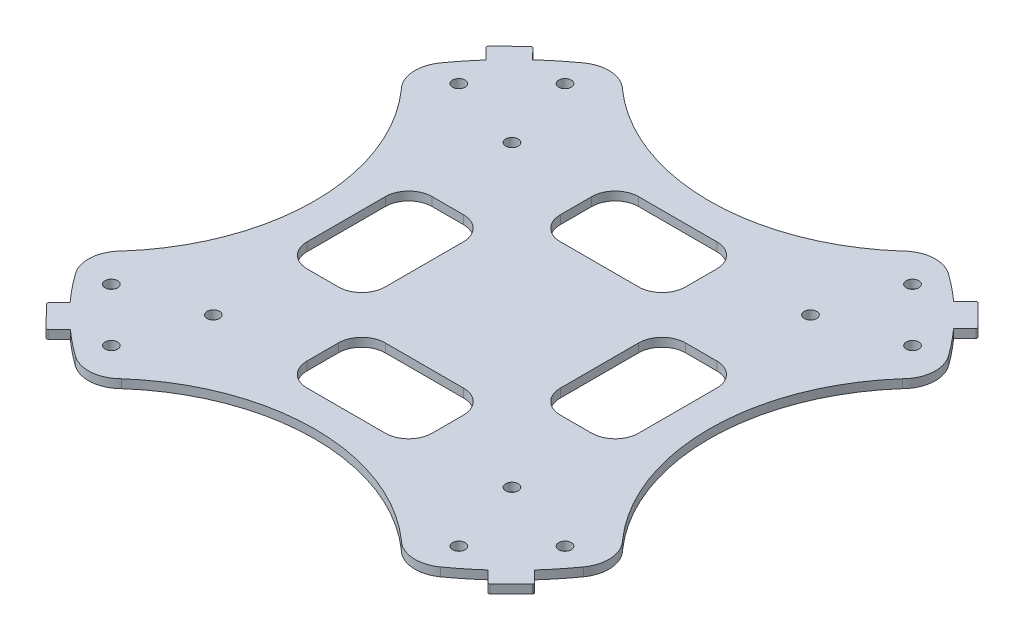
ISO-10303-21;
HEADER;
FILE_DESCRIPTION(('STEP AP214'),'2;1');
FILE_NAME('part.step','',(''),(''),'','','');
FILE_SCHEMA(('AUTOMOTIVE_DESIGN { 1 0 10303 214 1 1 1 1 }'));
ENDSEC;
DATA;
#1=APPLICATION_CONTEXT('core data for automotive mechanical design processes');
#2=APPLICATION_PROTOCOL_DEFINITION('international standard','automotive_design',2000,#1);
#3=PRODUCT_CONTEXT('',#1,'mechanical');
#4=PRODUCT('Part','Part','',(#3));
#5=PRODUCT_RELATED_PRODUCT_CATEGORY('part','',(#4));
#6=PRODUCT_DEFINITION_FORMATION('','',#4);
#7=PRODUCT_DEFINITION_CONTEXT('part definition',#1,'design');
#8=PRODUCT_DEFINITION('design','',#6,#7);
#9=PRODUCT_DEFINITION_SHAPE('','',#8);
#10=(LENGTH_UNIT() NAMED_UNIT(*) SI_UNIT(.MILLI.,.METRE.));
#11=(NAMED_UNIT(*) PLANE_ANGLE_UNIT() SI_UNIT($,.RADIAN.));
#12=(NAMED_UNIT(*) SI_UNIT($,.STERADIAN.) SOLID_ANGLE_UNIT());
#13=UNCERTAINTY_MEASURE_WITH_UNIT(LENGTH_MEASURE(1.E-05),#10,'distance_accuracy_value','');
#14=(GEOMETRIC_REPRESENTATION_CONTEXT(3) GLOBAL_UNCERTAINTY_ASSIGNED_CONTEXT((#13)) GLOBAL_UNIT_ASSIGNED_CONTEXT((#10,
#11,#12)) REPRESENTATION_CONTEXT('',''));
#15=CARTESIAN_POINT('',(0.,0.,0.));
#16=DIRECTION('',(0.,0.,1.));
#17=DIRECTION('',(1.,0.,0.));
#18=AXIS2_PLACEMENT_3D('',#15,#16,#17);
#19=CARTESIAN_POINT('',(0.,1.397,0.));
#20=DIRECTION('',(0.,1.,0.));
#21=DIRECTION('',(0.,0.,1.));
#22=AXIS2_PLACEMENT_3D('',#19,#20,#21);
#23=PLANE('',#22);
#24=CARTESIAN_POINT('',(-23.1140000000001,1.397,6.34999999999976));
#25=DIRECTION('',(0.,1.,0.));
#26=DIRECTION('',(0.,0.,-1.));
#27=AXIS2_PLACEMENT_3D('',#24,#25,#26);
#28=CIRCLE('',#27,3.81);
#29=CARTESIAN_POINT('',(-26.9240000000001,1.397,6.34999999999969));
#30=VERTEX_POINT('',#29);
#31=CARTESIAN_POINT('',(-23.1140000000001,1.397,10.1599999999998));
#32=VERTEX_POINT('',#31);
#33=EDGE_CURVE('E52',#30,#32,#28,.T.);
#34=ORIENTED_EDGE('',*,*,#33,.F.);
#35=DIRECTION('',(0.,0.,1.));
#36=VECTOR('',#35,1.);
#37=CARTESIAN_POINT('',(-26.9240000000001,1.397,6.34999999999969));
#38=LINE('',#37,#36);
#39=CARTESIAN_POINT('',(-26.9239999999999,1.397,-6.35000000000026));
#40=VERTEX_POINT('',#39);
#41=EDGE_CURVE('E505',#40,#30,#38,.T.);
#42=ORIENTED_EDGE('',*,*,#41,.F.);
#43=CARTESIAN_POINT('',(-23.1139999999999,1.397,-6.35000000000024));
#44=DIRECTION('',(0.,1.,0.));
#45=DIRECTION('',(0.,0.,1.));
#46=AXIS2_PLACEMENT_3D('',#43,#44,#45);
#47=CIRCLE('',#46,3.81);
#48=CARTESIAN_POINT('',(-23.1139999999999,1.397,-10.1600000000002));
#49=VERTEX_POINT('',#48);
#50=EDGE_CURVE('E508',#49,#40,#47,.T.);
#51=ORIENTED_EDGE('',*,*,#50,.F.);
#52=DIRECTION('',(-1.,0.,0.));
#53=VECTOR('',#52,1.);
#54=CARTESIAN_POINT('',(-23.1139999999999,1.397,-10.1600000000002));
#55=LINE('',#54,#53);
#56=CARTESIAN_POINT('',(-18.0339999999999,1.397,-10.1600000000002));
#57=VERTEX_POINT('',#56);
#58=EDGE_CURVE('E536',#57,#49,#55,.T.);
#59=ORIENTED_EDGE('',*,*,#58,.F.);
#60=CARTESIAN_POINT('',(-18.0339999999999,1.397,-6.35000000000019));
#61=DIRECTION('',(0.,1.,0.));
#62=DIRECTION('',(0.,0.,-1.));
#63=AXIS2_PLACEMENT_3D('',#60,#61,#62);
#64=CIRCLE('',#63,3.81);
#65=CARTESIAN_POINT('',(-14.2239999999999,1.397,-6.35000000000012));
#66=VERTEX_POINT('',#65);
#67=EDGE_CURVE('E533',#66,#57,#64,.T.);
#68=ORIENTED_EDGE('',*,*,#67,.F.);
#69=DIRECTION('',(0.,0.,-1.));
#70=VECTOR('',#69,1.);
#71=CARTESIAN_POINT('',(-14.2240000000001,1.397,6.34999999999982));
#72=LINE('',#71,#70);
#73=CARTESIAN_POINT('',(-14.2240000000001,1.397,6.34999999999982));
#74=VERTEX_POINT('',#73);
#75=EDGE_CURVE('E530',#74,#66,#72,.T.);
#76=ORIENTED_EDGE('',*,*,#75,.F.);
#77=CARTESIAN_POINT('',(-18.0340000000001,1.397,6.34999999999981));
#78=DIRECTION('',(0.,1.,0.));
#79=DIRECTION('',(0.,0.,1.));
#80=AXIS2_PLACEMENT_3D('',#77,#78,#79);
#81=CIRCLE('',#80,3.81);
#82=CARTESIAN_POINT('',(-18.0340000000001,1.397,10.1599999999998));
#83=VERTEX_POINT('',#82);
#84=EDGE_CURVE('E527',#83,#74,#81,.T.);
#85=ORIENTED_EDGE('',*,*,#84,.F.);
#86=DIRECTION('',(1.,0.,0.));
#87=VECTOR('',#86,1.);
#88=CARTESIAN_POINT('',(-23.1140000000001,1.397,10.1599999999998));
#89=LINE('',#88,#87);
#90=EDGE_CURVE('E525',#32,#83,#89,.T.);
#91=ORIENTED_EDGE('',*,*,#90,.F.);
#92=EDGE_LOOP('',(#34,#42,#51,#59,#68,#76,#85,#91));
#93=FACE_BOUND('',#92,.T.);
#94=CARTESIAN_POINT('',(6.34999999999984,1.397,23.114));
#95=DIRECTION('',(0.,1.,0.));
#96=DIRECTION('',(0.,0.,-1.));
#97=AXIS2_PLACEMENT_3D('',#94,#95,#96);
#98=CIRCLE('',#97,3.81);
#99=CARTESIAN_POINT('',(6.34999999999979,1.397,26.924));
#100=VERTEX_POINT('',#99);
#101=CARTESIAN_POINT('',(10.1599999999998,1.397,23.114));
#102=VERTEX_POINT('',#101);
#103=EDGE_CURVE('E543',#100,#102,#98,.T.);
#104=ORIENTED_EDGE('',*,*,#103,.F.);
#105=DIRECTION('',(1.,0.,0.));
#106=VECTOR('',#105,1.);
#107=CARTESIAN_POINT('',(6.34999999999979,1.397,26.924));
#108=LINE('',#107,#106);
#109=CARTESIAN_POINT('',(-6.35000000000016,1.397,26.924));
#110=VERTEX_POINT('',#109);
#111=EDGE_CURVE('E559',#110,#100,#108,.T.);
#112=ORIENTED_EDGE('',*,*,#111,.F.);
#113=CARTESIAN_POINT('',(-6.35000000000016,1.397,23.114));
#114=DIRECTION('',(0.,1.,0.));
#115=DIRECTION('',(0.,0.,1.));
#116=AXIS2_PLACEMENT_3D('',#113,#114,#115);
#117=CIRCLE('',#116,3.81);
#118=CARTESIAN_POINT('',(-10.1600000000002,1.397,23.1139999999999));
#119=VERTEX_POINT('',#118);
#120=EDGE_CURVE('E597',#119,#110,#117,.T.);
#121=ORIENTED_EDGE('',*,*,#120,.F.);
#122=DIRECTION('',(0.,0.,1.));
#123=VECTOR('',#122,1.);
#124=CARTESIAN_POINT('',(-10.1600000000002,1.397,23.1139999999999));
#125=LINE('',#124,#123);
#126=CARTESIAN_POINT('',(-10.1600000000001,1.397,18.034));
#127=VERTEX_POINT('',#126);
#128=EDGE_CURVE('E594',#127,#119,#125,.T.);
#129=ORIENTED_EDGE('',*,*,#128,.F.);
#130=CARTESIAN_POINT('',(-6.35000000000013,1.397,18.034));
#131=DIRECTION('',(0.,1.,0.));
#132=DIRECTION('',(0.,0.,-1.));
#133=AXIS2_PLACEMENT_3D('',#130,#131,#132);
#134=CIRCLE('',#133,3.81);
#135=CARTESIAN_POINT('',(-6.35000000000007,1.397,14.224));
#136=VERTEX_POINT('',#135);
#137=EDGE_CURVE('E591',#136,#127,#134,.T.);
#138=ORIENTED_EDGE('',*,*,#137,.F.);
#139=DIRECTION('',(-1.,0.,0.));
#140=VECTOR('',#139,1.);
#141=CARTESIAN_POINT('',(6.34999999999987,1.397,14.224));
#142=LINE('',#141,#140);
#143=CARTESIAN_POINT('',(6.34999999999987,1.397,14.224));
#144=VERTEX_POINT('',#143);
#145=EDGE_CURVE('E588',#144,#136,#142,.T.);
#146=ORIENTED_EDGE('',*,*,#145,.F.);
#147=CARTESIAN_POINT('',(6.34999999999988,1.397,18.034));
#148=DIRECTION('',(0.,1.,0.));
#149=DIRECTION('',(0.,0.,1.));
#150=AXIS2_PLACEMENT_3D('',#147,#148,#149);
#151=CIRCLE('',#150,3.81);
#152=CARTESIAN_POINT('',(10.1599999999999,1.397,18.0340000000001));
#153=VERTEX_POINT('',#152);
#154=EDGE_CURVE('E585',#153,#144,#151,.T.);
#155=ORIENTED_EDGE('',*,*,#154,.F.);
#156=DIRECTION('',(0.,0.,-1.));
#157=VECTOR('',#156,1.);
#158=CARTESIAN_POINT('',(10.1599999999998,1.397,23.114));
#159=LINE('',#158,#157);
#160=EDGE_CURVE('E582',#102,#153,#159,.T.);
#161=ORIENTED_EDGE('',*,*,#160,.F.);
#162=EDGE_LOOP('',(#104,#112,#121,#129,#138,#146,#155,#161));
#163=FACE_BOUND('',#162,.T.);
#164=CARTESIAN_POINT('',(23.114,1.397,-6.34999999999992));
#165=DIRECTION('',(0.,1.,0.));
#166=DIRECTION('',(0.,0.,-1.));
#167=AXIS2_PLACEMENT_3D('',#164,#165,#166);
#168=CIRCLE('',#167,3.81);
#169=CARTESIAN_POINT('',(26.924,1.397,-6.34999999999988));
#170=VERTEX_POINT('',#169);
#171=CARTESIAN_POINT('',(23.114,1.397,-10.1599999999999));
#172=VERTEX_POINT('',#171);
#173=EDGE_CURVE('E604',#170,#172,#168,.T.);
#174=ORIENTED_EDGE('',*,*,#173,.F.);
#175=DIRECTION('',(0.,0.,-1.));
#176=VECTOR('',#175,1.);
#177=CARTESIAN_POINT('',(26.924,1.397,-6.34999999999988));
#178=LINE('',#177,#176);
#179=CARTESIAN_POINT('',(26.924,1.397,6.35000000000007));
#180=VERTEX_POINT('',#179);
#181=EDGE_CURVE('E623',#180,#170,#178,.T.);
#182=ORIENTED_EDGE('',*,*,#181,.F.);
#183=CARTESIAN_POINT('',(23.114,1.397,6.35000000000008));
#184=DIRECTION('',(0.,1.,0.));
#185=DIRECTION('',(0.,0.,1.));
#186=AXIS2_PLACEMENT_3D('',#183,#184,#185);
#187=CIRCLE('',#186,3.81);
#188=CARTESIAN_POINT('',(23.1139999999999,1.397,10.1600000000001));
#189=VERTEX_POINT('',#188);
#190=EDGE_CURVE('E661',#189,#180,#187,.T.);
#191=ORIENTED_EDGE('',*,*,#190,.F.);
#192=DIRECTION('',(1.,0.,0.));
#193=VECTOR('',#192,1.);
#194=CARTESIAN_POINT('',(23.1139999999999,1.397,10.1600000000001));
#195=LINE('',#194,#193);
#196=CARTESIAN_POINT('',(18.034,1.397,10.1600000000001));
#197=VERTEX_POINT('',#196);
#198=EDGE_CURVE('E658',#197,#189,#195,.T.);
#199=ORIENTED_EDGE('',*,*,#198,.F.);
#200=CARTESIAN_POINT('',(18.034,1.397,6.35000000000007));
#201=DIRECTION('',(0.,1.,0.));
#202=DIRECTION('',(0.,0.,-1.));
#203=AXIS2_PLACEMENT_3D('',#200,#201,#202);
#204=CIRCLE('',#203,3.81);
#205=CARTESIAN_POINT('',(14.224,1.397,6.35000000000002));
#206=VERTEX_POINT('',#205);
#207=EDGE_CURVE('E655',#206,#197,#204,.T.);
#208=ORIENTED_EDGE('',*,*,#207,.F.);
#209=DIRECTION('',(0.,0.,1.));
#210=VECTOR('',#209,1.);
#211=CARTESIAN_POINT('',(14.224,1.397,-6.34999999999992));
#212=LINE('',#211,#210);
#213=CARTESIAN_POINT('',(14.224,1.397,-6.34999999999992));
#214=VERTEX_POINT('',#213);
#215=EDGE_CURVE('E652',#214,#206,#212,.T.);
#216=ORIENTED_EDGE('',*,*,#215,.F.);
#217=CARTESIAN_POINT('',(18.034,1.397,-6.34999999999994));
#218=DIRECTION('',(0.,1.,0.));
#219=DIRECTION('',(0.,0.,1.));
#220=AXIS2_PLACEMENT_3D('',#217,#218,#219);
#221=CIRCLE('',#220,3.81);
#222=CARTESIAN_POINT('',(18.0340000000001,1.397,-10.1599999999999));
#223=VERTEX_POINT('',#222);
#224=EDGE_CURVE('E649',#223,#214,#221,.T.);
#225=ORIENTED_EDGE('',*,*,#224,.F.);
#226=DIRECTION('',(-1.,0.,0.));
#227=VECTOR('',#226,1.);
#228=CARTESIAN_POINT('',(23.114,1.397,-10.1599999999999));
#229=LINE('',#228,#227);
#230=EDGE_CURVE('E646',#172,#223,#229,.T.);
#231=ORIENTED_EDGE('',*,*,#230,.F.);
#232=EDGE_LOOP('',(#174,#182,#191,#199,#208,#216,#225,#231));
#233=FACE_BOUND('',#232,.T.);
#234=CARTESIAN_POINT('',(-6.35,1.397,-23.114));
#235=DIRECTION('',(0.,1.,0.));
#236=DIRECTION('',(0.,0.,-1.));
#237=AXIS2_PLACEMENT_3D('',#234,#235,#236);
#238=CIRCLE('',#237,3.81);
#239=CARTESIAN_POINT('',(-6.34999999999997,1.397,-26.924));
#240=VERTEX_POINT('',#239);
#241=CARTESIAN_POINT('',(-10.16,1.397,-23.114));
#242=VERTEX_POINT('',#241);
#243=EDGE_CURVE('E668',#240,#242,#238,.T.);
#244=ORIENTED_EDGE('',*,*,#243,.F.);
#245=DIRECTION('',(-1.,0.,0.));
#246=VECTOR('',#245,1.);
#247=CARTESIAN_POINT('',(-6.34999999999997,1.397,-26.924));
#248=LINE('',#247,#246);
#249=CARTESIAN_POINT('',(6.34999999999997,1.397,-26.924));
#250=VERTEX_POINT('',#249);
#251=EDGE_CURVE('E687',#250,#240,#248,.T.);
#252=ORIENTED_EDGE('',*,*,#251,.F.);
#253=CARTESIAN_POINT('',(6.35,1.397,-23.114));
#254=DIRECTION('',(0.,1.,0.));
#255=DIRECTION('',(0.,0.,1.));
#256=AXIS2_PLACEMENT_3D('',#253,#254,#255);
#257=CIRCLE('',#256,3.81);
#258=CARTESIAN_POINT('',(10.16,1.397,-23.114));
#259=VERTEX_POINT('',#258);
#260=EDGE_CURVE('E725',#259,#250,#257,.T.);
#261=ORIENTED_EDGE('',*,*,#260,.F.);
#262=DIRECTION('',(0.,0.,-1.));
#263=VECTOR('',#262,1.);
#264=CARTESIAN_POINT('',(10.16,1.397,-23.114));
#265=LINE('',#264,#263);
#266=CARTESIAN_POINT('',(10.16,1.397,-18.034));
#267=VERTEX_POINT('',#266);
#268=EDGE_CURVE('E722',#267,#259,#265,.T.);
#269=ORIENTED_EDGE('',*,*,#268,.F.);
#270=CARTESIAN_POINT('',(6.35,1.397,-18.034));
#271=DIRECTION('',(0.,1.,0.));
#272=DIRECTION('',(0.,0.,-1.));
#273=AXIS2_PLACEMENT_3D('',#270,#271,#272);
#274=CIRCLE('',#273,3.81);
#275=CARTESIAN_POINT('',(6.34999999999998,1.397,-14.224));
#276=VERTEX_POINT('',#275);
#277=EDGE_CURVE('E719',#276,#267,#274,.T.);
#278=ORIENTED_EDGE('',*,*,#277,.F.);
#279=DIRECTION('',(1.,0.,0.));
#280=VECTOR('',#279,1.);
#281=CARTESIAN_POINT('',(-6.34999999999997,1.397,-14.224));
#282=LINE('',#281,#280);
#283=CARTESIAN_POINT('',(-6.34999999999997,1.397,-14.224));
#284=VERTEX_POINT('',#283);
#285=EDGE_CURVE('E716',#284,#276,#282,.T.);
#286=ORIENTED_EDGE('',*,*,#285,.F.);
#287=CARTESIAN_POINT('',(-6.35,1.397,-18.034));
#288=DIRECTION('',(0.,1.,0.));
#289=DIRECTION('',(0.,0.,1.));
#290=AXIS2_PLACEMENT_3D('',#287,#288,#289);
#291=CIRCLE('',#290,3.81);
#292=CARTESIAN_POINT('',(-10.16,1.397,-18.034));
#293=VERTEX_POINT('',#292);
#294=EDGE_CURVE('E713',#293,#284,#291,.T.);
#295=ORIENTED_EDGE('',*,*,#294,.F.);
#296=DIRECTION('',(0.,0.,1.));
#297=VECTOR('',#296,1.);
#298=CARTESIAN_POINT('',(-10.16,1.397,-23.114));
#299=LINE('',#298,#297);
#300=EDGE_CURVE('E710',#242,#293,#299,.T.);
#301=ORIENTED_EDGE('',*,*,#300,.F.);
#302=EDGE_LOOP('',(#244,#252,#261,#269,#278,#286,#295,#301));
#303=FACE_BOUND('',#302,.T.);
#304=CARTESIAN_POINT('',(-28.2201702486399,1.397,36.8412161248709));
#305=DIRECTION('',(0.,1.,0.));
#306=DIRECTION('',(0.,0.,-1.));
#307=AXIS2_PLACEMENT_3D('',#304,#305,#306);
#308=CIRCLE('',#307,1.01599999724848);
#309=CARTESIAN_POINT('',(-28.2201702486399,1.397,35.8252161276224));
#310=VERTEX_POINT('',#309);
#311=EDGE_CURVE('E753',#310,#310,#308,.T.);
#312=ORIENTED_EDGE('',*,*,#311,.F.);
#313=EDGE_LOOP('',(#312));
#314=FACE_BOUND('',#313,.T.);
#315=CARTESIAN_POINT('',(24.2454639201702,1.397,24.2454639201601));
#316=DIRECTION('',(0.,1.,0.));
#317=DIRECTION('',(0.,0.,1.));
#318=AXIS2_PLACEMENT_3D('',#315,#316,#317);
#319=CIRCLE('',#318,1.01599999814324);
#320=CARTESIAN_POINT('',(24.2454639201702,1.397,25.2614639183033));
#321=VERTEX_POINT('',#320);
#322=EDGE_CURVE('E765',#321,#321,#319,.T.);
#323=ORIENTED_EDGE('',*,*,#322,.F.);
#324=EDGE_LOOP('',(#323));
#325=FACE_BOUND('',#324,.T.);
#326=CARTESIAN_POINT('',(28.2201702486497,1.397,36.8412161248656));
#327=DIRECTION('',(0.,1.,0.));
#328=DIRECTION('',(0.,0.,1.));
#329=AXIS2_PLACEMENT_3D('',#326,#327,#328);
#330=CIRCLE('',#329,1.01599999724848);
#331=CARTESIAN_POINT('',(28.2201702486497,1.397,37.8572161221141));
#332=VERTEX_POINT('',#331);
#333=EDGE_CURVE('E777',#332,#332,#330,.T.);
#334=ORIENTED_EDGE('',*,*,#333,.F.);
#335=EDGE_LOOP('',(#334));
#336=FACE_BOUND('',#335,.T.);
#337=CARTESIAN_POINT('',(28.2201702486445,1.397,-36.8412161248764));
#338=DIRECTION('',(0.,1.,0.));
#339=DIRECTION('',(0.,0.,-1.));
#340=AXIS2_PLACEMENT_3D('',#337,#338,#339);
#341=CIRCLE('',#340,1.01599999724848);
#342=CARTESIAN_POINT('',(28.2201702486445,1.397,-37.8572161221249));
#343=VERTEX_POINT('',#342);
#344=EDGE_CURVE('E789',#343,#343,#341,.T.);
#345=ORIENTED_EDGE('',*,*,#344,.F.);
#346=EDGE_LOOP('',(#345));
#347=FACE_BOUND('',#346,.T.);
#348=CARTESIAN_POINT('',(-24.2454639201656,1.397,-24.2454639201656));
#349=DIRECTION('',(0.,1.,0.));
#350=DIRECTION('',(0.,0.,1.));
#351=AXIS2_PLACEMENT_3D('',#348,#349,#350);
#352=CIRCLE('',#351,1.01599999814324);
#353=CARTESIAN_POINT('',(-24.2454639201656,1.397,-23.2294639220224));
#354=VERTEX_POINT('',#353);
#355=EDGE_CURVE('E801',#354,#354,#352,.T.);
#356=ORIENTED_EDGE('',*,*,#355,.F.);
#357=EDGE_LOOP('',(#356));
#358=FACE_BOUND('',#357,.T.);
#359=CARTESIAN_POINT('',(-28.2201702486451,1.397,-36.8412161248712));
#360=DIRECTION('',(0.,1.,0.));
#361=DIRECTION('',(0.,0.,1.));
#362=AXIS2_PLACEMENT_3D('',#359,#360,#361);
#363=CIRCLE('',#362,1.01599999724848);
#364=CARTESIAN_POINT('',(-28.2201702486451,1.397,-35.8252161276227));
#365=VERTEX_POINT('',#364);
#366=EDGE_CURVE('E813',#365,#365,#363,.T.);
#367=ORIENTED_EDGE('',*,*,#366,.F.);
#368=EDGE_LOOP('',(#367));
#369=FACE_BOUND('',#368,.T.);
#370=CARTESIAN_POINT('',(0.,1.397,0.));
#371=DIRECTION('',(0.,1.,0.));
#372=DIRECTION('',(0.,0.,1.));
#373=AXIS2_PLACEMENT_3D('',#370,#371,#372);
#374=CIRCLE('',#373,50.8);
#375=CARTESIAN_POINT('',(-29.6485536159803,1.397,-41.2504941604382));
#376=VERTEX_POINT('',#375);
#377=CARTESIAN_POINT('',(-34.2032816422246,1.397,-37.5602918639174));
#378=VERTEX_POINT('',#377);
#379=EDGE_CURVE('E819',#376,#378,#374,.T.);
#380=ORIENTED_EDGE('',*,*,#379,.T.);
#381=DIRECTION('',(-0.698943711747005,0.,-0.715176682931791));
#382=VECTOR('',#381,1.);
#383=CARTESIAN_POINT('',(-34.2032816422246,1.397,-37.5602918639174));
#384=LINE('',#383,#382);
#385=CARTESIAN_POINT('',(-35.8918427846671,1.397,-39.2880698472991));
#386=VERTEX_POINT('',#385);
#387=EDGE_CURVE('E822',#378,#386,#384,.T.);
#388=ORIENTED_EDGE('',*,*,#387,.T.);
#389=CARTESIAN_POINT('',(-36.0734976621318,1.397,-39.1105381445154));
#390=DIRECTION('',(0.,1.,0.));
#391=DIRECTION('',(0.,0.,-1.));
#392=AXIS2_PLACEMENT_3D('',#389,#390,#391);
#393=CIRCLE('',#392,0.253999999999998);
#394=CARTESIAN_POINT('',(-36.2510293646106,1.397,-39.2921930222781));
#395=VERTEX_POINT('',#394);
#396=EDGE_CURVE('E825',#386,#395,#393,.T.);
#397=ORIENTED_EDGE('',*,*,#396,.T.);
#398=DIRECTION('',(-0.715176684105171,0.,0.698943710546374));
#399=VECTOR('',#398,1.);
#400=CARTESIAN_POINT('',(-39.7221066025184,1.397,-35.8999017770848));
#401=LINE('',#400,#399);
#402=CARTESIAN_POINT('',(-39.7221066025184,1.397,-35.8999017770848));
#403=VERTEX_POINT('',#402);
#404=EDGE_CURVE('E827',#395,#403,#401,.T.);
#405=ORIENTED_EDGE('',*,*,#404,.T.);
#406=CARTESIAN_POINT('',(-39.5445749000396,1.397,-35.7182468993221));
#407=DIRECTION('',(0.,1.,0.));
#408=DIRECTION('',(0.,0.,1.));
#409=AXIS2_PLACEMENT_3D('',#406,#407,#408);
#410=CIRCLE('',#409,0.253999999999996);
#411=CARTESIAN_POINT('',(-39.724180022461,1.397,-35.5386417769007));
#412=VERTEX_POINT('',#411);
#413=EDGE_CURVE('E829',#403,#412,#410,.T.);
#414=ORIENTED_EDGE('',*,*,#413,.T.);
#415=DIRECTION('',(0.707106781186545,0.,0.70710678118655));
#416=VECTOR('',#415,1.);
#417=CARTESIAN_POINT('',(-37.9527791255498,1.397,-33.7672408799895));
#418=LINE('',#417,#416);
#419=CARTESIAN_POINT('',(-37.9527791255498,1.397,-33.7672408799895));
#420=VERTEX_POINT('',#419);
#421=EDGE_CURVE('E831',#412,#420,#418,.T.);
#422=ORIENTED_EDGE('',*,*,#421,.T.);
#423=CARTESIAN_POINT('',(0.,1.397,0.));
#424=DIRECTION('',(0.,1.,0.));
#425=DIRECTION('',(0.,0.,1.));
#426=AXIS2_PLACEMENT_3D('',#423,#424,#425);
#427=CIRCLE('',#426,50.8);
#428=CARTESIAN_POINT('',(-41.2504941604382,1.397,-29.6485536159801));
#429=VERTEX_POINT('',#428);
#430=EDGE_CURVE('E833',#420,#429,#427,.T.);
#431=ORIENTED_EDGE('',*,*,#430,.T.);
#432=CARTESIAN_POINT('',(-36.8963482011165,1.397,-26.5190364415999));
#433=DIRECTION('',(0.,1.,0.));
#434=DIRECTION('',(0.,0.,-1.));
#435=AXIS2_PLACEMENT_3D('',#432,#433,#434);
#436=CIRCLE('',#435,5.36213248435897);
#437=CARTESIAN_POINT('',(-40.6879484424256,1.397,-22.7274362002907));
#438=VERTEX_POINT('',#437);
#439=EDGE_CURVE('E835',#429,#438,#436,.T.);
#440=ORIENTED_EDGE('',*,*,#439,.T.);
#441=CARTESIAN_POINT('',(-66.2866337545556,1.397,-3.48887894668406E-12));
#442=DIRECTION('',(0.,-1.,0.));
#443=DIRECTION('',(0.,0.,1.));
#444=AXIS2_PLACEMENT_3D('',#441,#442,#443);
#445=CIRCLE('',#444,34.2319886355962);
#446=CARTESIAN_POINT('',(-40.6879484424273,1.397,22.7274362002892));
#447=VERTEX_POINT('',#446);
#448=EDGE_CURVE('E837',#438,#447,#445,.T.);
#449=ORIENTED_EDGE('',*,*,#448,.T.);
#450=CARTESIAN_POINT('',(-36.8963482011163,1.397,26.5190364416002));
#451=DIRECTION('',(0.,1.,0.));
#452=DIRECTION('',(0.,0.,1.));
#453=AXIS2_PLACEMENT_3D('',#450,#451,#452);
#454=CIRCLE('',#453,5.36213248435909);
#455=CARTESIAN_POINT('',(-41.2504941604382,1.397,29.6485536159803));
#456=VERTEX_POINT('',#455);
#457=EDGE_CURVE('E839',#447,#456,#454,.T.);
#458=ORIENTED_EDGE('',*,*,#457,.T.);
#459=CARTESIAN_POINT('',(0.,1.397,0.));
#460=DIRECTION('',(0.,1.,0.));
#461=DIRECTION('',(0.,0.,1.));
#462=AXIS2_PLACEMENT_3D('',#459,#460,#461);
#463=CIRCLE('',#462,50.8);
#464=CARTESIAN_POINT('',(-37.6037771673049,1.397,34.1554672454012));
#465=VERTEX_POINT('',#464);
#466=EDGE_CURVE('E841',#456,#465,#463,.T.);
#467=ORIENTED_EDGE('',*,*,#466,.T.);
#468=DIRECTION('',(-0.707106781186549,0.,0.707106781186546));
#469=VECTOR('',#468,1.);
#470=CARTESIAN_POINT('',(-37.6037771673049,1.397,34.1554672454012));
#471=LINE('',#470,#469);
#472=CARTESIAN_POINT('',(-39.3423335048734,1.397,35.8940235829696));
#473=VERTEX_POINT('',#472);
#474=EDGE_CURVE('E843',#465,#473,#471,.T.);
#475=ORIENTED_EDGE('',*,*,#474,.T.);
#476=CARTESIAN_POINT('',(-39.162728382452,1.397,36.073628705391));
#477=DIRECTION('',(0.,1.,0.));
#478=DIRECTION('',(0.,0.,1.));
#479=AXIS2_PLACEMENT_3D('',#476,#477,#478);
#480=CIRCLE('',#479,0.254000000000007);
#481=CARTESIAN_POINT('',(-39.3443832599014,1.397,36.2511604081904));
#482=VERTEX_POINT('',#481);
#483=EDGE_CURVE('E845',#473,#482,#480,.T.);
#484=ORIENTED_EDGE('',*,*,#483,.T.);
#485=DIRECTION('',(0.698943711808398,0.,0.715176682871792));
#486=VECTOR('',#485,1.);
#487=CARTESIAN_POINT('',(-35.99684677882,1.397,39.6764434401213));
#488=LINE('',#487,#486);
#489=CARTESIAN_POINT('',(-35.99684677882,1.397,39.6764434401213));
#490=VERTEX_POINT('',#489);
#491=EDGE_CURVE('E847',#482,#490,#488,.T.);
#492=ORIENTED_EDGE('',*,*,#491,.T.);
#493=CARTESIAN_POINT('',(-35.7937190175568,1.397,39.5239471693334));
#494=DIRECTION('',(0.,1.,0.));
#495=DIRECTION('',(0.,0.,-1.));
#496=AXIS2_PLACEMENT_3D('',#493,#494,#495);
#497=CIRCLE('',#496,0.254);
#498=CARTESIAN_POINT('',(-35.6141138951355,1.397,39.7035522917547));
#499=VERTEX_POINT('',#498);
#500=EDGE_CURVE('E849',#490,#499,#497,.T.);
#501=ORIENTED_EDGE('',*,*,#500,.T.);
#502=DIRECTION('',(0.70710678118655,0.,-0.707106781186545));
#503=VECTOR('',#502,1.);
#504=CARTESIAN_POINT('',(-35.6141138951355,1.397,39.7035522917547));
#505=LINE('',#504,#503);
#506=CARTESIAN_POINT('',(-33.8180626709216,1.397,37.9075010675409));
#507=VERTEX_POINT('',#506);
#508=EDGE_CURVE('E851',#499,#507,#505,.T.);
#509=ORIENTED_EDGE('',*,*,#508,.T.);
#510=CARTESIAN_POINT('',(0.,1.397,0.));
#511=DIRECTION('',(0.,1.,0.));
#512=DIRECTION('',(0.,0.,1.));
#513=AXIS2_PLACEMENT_3D('',#510,#511,#512);
#514=CIRCLE('',#513,50.8);
#515=CARTESIAN_POINT('',(-29.6485536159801,1.397,41.2504941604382));
#516=VERTEX_POINT('',#515);
#517=EDGE_CURVE('E853',#507,#516,#514,.T.);
#518=ORIENTED_EDGE('',*,*,#517,.T.);
#519=CARTESIAN_POINT('',(-26.5190364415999,1.397,36.8963482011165));
#520=DIRECTION('',(0.,1.,0.));
#521=DIRECTION('',(0.,0.,-1.));
#522=AXIS2_PLACEMENT_3D('',#519,#520,#521);
#523=CIRCLE('',#522,5.36213248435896);
#524=CARTESIAN_POINT('',(-22.7274362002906,1.397,40.6879484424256));
#525=VERTEX_POINT('',#524);
#526=EDGE_CURVE('E855',#516,#525,#523,.T.);
#527=ORIENTED_EDGE('',*,*,#526,.T.);
#528=CARTESIAN_POINT('',(-3.48336356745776E-12,1.397,66.2866337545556));
#529=DIRECTION('',(0.,-1.,0.));
#530=DIRECTION('',(0.,0.,1.));
#531=AXIS2_PLACEMENT_3D('',#528,#529,#530);
#532=CIRCLE('',#531,34.2319886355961);
#533=CARTESIAN_POINT('',(22.7274362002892,1.397,40.6879484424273));
#534=VERTEX_POINT('',#533);
#535=EDGE_CURVE('E857',#525,#534,#532,.T.);
#536=ORIENTED_EDGE('',*,*,#535,.T.);
#537=CARTESIAN_POINT('',(26.5190364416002,1.397,36.8963482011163));
#538=DIRECTION('',(0.,1.,0.));
#539=DIRECTION('',(0.,0.,1.));
#540=AXIS2_PLACEMENT_3D('',#537,#538,#539);
#541=CIRCLE('',#540,5.36213248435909);
#542=CARTESIAN_POINT('',(29.6485536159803,1.397,41.2504941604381));
#543=VERTEX_POINT('',#542);
#544=EDGE_CURVE('E859',#534,#543,#541,.T.);
#545=ORIENTED_EDGE('',*,*,#544,.T.);
#546=CARTESIAN_POINT('',(0.,1.397,0.));
#547=DIRECTION('',(0.,1.,0.));
#548=DIRECTION('',(0.,0.,1.));
#549=AXIS2_PLACEMENT_3D('',#546,#547,#548);
#550=CIRCLE('',#549,50.8);
#551=CARTESIAN_POINT('',(33.9375571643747,1.397,37.8005583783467));
#552=VERTEX_POINT('',#551);
#553=EDGE_CURVE('E861',#543,#552,#550,.T.);
#554=ORIENTED_EDGE('',*,*,#553,.T.);
#555=DIRECTION('',(0.698943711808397,0.,0.715176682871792));
#556=VECTOR('',#555,1.);
#557=CARTESIAN_POINT('',(35.712874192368,1.397,39.6171071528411));
#558=LINE('',#557,#556);
#559=CARTESIAN_POINT('',(35.712874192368,1.397,39.6171071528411));
#560=VERTEX_POINT('',#559);
#561=EDGE_CURVE('E863',#552,#560,#558,.T.);
#562=ORIENTED_EDGE('',*,*,#561,.T.);
#563=CARTESIAN_POINT('',(35.8945290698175,1.397,39.4395754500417));
#564=DIRECTION('',(0.,1.,0.));
#565=DIRECTION('',(0.,0.,1.));
#566=AXIS2_PLACEMENT_3D('',#563,#564,#565);
#567=CIRCLE('',#566,0.254000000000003);
#568=CARTESIAN_POINT('',(36.0818576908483,1.397,39.6111096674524));
#569=VERTEX_POINT('',#568);
#570=EDGE_CURVE('E865',#560,#569,#567,.T.);
#571=ORIENTED_EDGE('',*,*,#570,.T.);
#572=DIRECTION('',(0.707106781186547,0.,-0.707106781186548));
#573=VECTOR('',#572,1.);
#574=CARTESIAN_POINT('',(39.5381892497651,1.397,36.1547781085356));
#575=LINE('',#574,#573);
#576=CARTESIAN_POINT('',(39.5381892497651,1.397,36.1547781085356));
#577=VERTEX_POINT('',#576);
#578=EDGE_CURVE('E867',#569,#577,#575,.T.);
#579=ORIENTED_EDGE('',*,*,#578,.T.);
#580=CARTESIAN_POINT('',(39.3282304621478,1.397,36.0118329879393));
#581=DIRECTION('',(0.,1.,0.));
#582=DIRECTION('',(0.,0.,-1.));
#583=AXIS2_PLACEMENT_3D('',#580,#581,#582);
#584=CIRCLE('',#583,0.254000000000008);
#585=CARTESIAN_POINT('',(39.5078355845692,1.397,35.8322278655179));
#586=VERTEX_POINT('',#585);
#587=EDGE_CURVE('E869',#577,#586,#584,.T.);
#588=ORIENTED_EDGE('',*,*,#587,.T.);
#589=DIRECTION('',(-0.707106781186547,0.,-0.707106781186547));
#590=VECTOR('',#589,1.);
#591=CARTESIAN_POINT('',(39.5078355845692,1.397,35.8322278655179));
#592=LINE('',#591,#590);
#593=CARTESIAN_POINT('',(37.7117843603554,1.397,34.0361766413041));
#594=VERTEX_POINT('',#593);
#595=EDGE_CURVE('E871',#586,#594,#592,.T.);
#596=ORIENTED_EDGE('',*,*,#595,.T.);
#597=CARTESIAN_POINT('',(0.,1.397,0.));
#598=DIRECTION('',(0.,1.,0.));
#599=DIRECTION('',(0.,0.,1.));
#600=AXIS2_PLACEMENT_3D('',#597,#598,#599);
#601=CIRCLE('',#600,50.8);
#602=CARTESIAN_POINT('',(41.2504941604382,1.397,29.6485536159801));
#603=VERTEX_POINT('',#602);
#604=EDGE_CURVE('E873',#594,#603,#601,.T.);
#605=ORIENTED_EDGE('',*,*,#604,.T.);
#606=CARTESIAN_POINT('',(36.8963482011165,1.397,26.5190364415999));
#607=DIRECTION('',(0.,1.,0.));
#608=DIRECTION('',(0.,0.,-1.));
#609=AXIS2_PLACEMENT_3D('',#606,#607,#608);
#610=CIRCLE('',#609,5.36213248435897);
#611=CARTESIAN_POINT('',(40.6879484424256,1.397,22.7274362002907));
#612=VERTEX_POINT('',#611);
#613=EDGE_CURVE('E875',#603,#612,#610,.T.);
#614=ORIENTED_EDGE('',*,*,#613,.T.);
#615=CARTESIAN_POINT('',(66.2866337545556,1.397,3.4969967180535E-12));
#616=DIRECTION('',(0.,-1.,0.));
#617=DIRECTION('',(0.,0.,1.));
#618=AXIS2_PLACEMENT_3D('',#615,#616,#617);
#619=CIRCLE('',#618,34.2319886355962);
#620=CARTESIAN_POINT('',(40.6879484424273,1.397,-22.7274362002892));
#621=VERTEX_POINT('',#620);
#622=EDGE_CURVE('E877',#612,#621,#619,.T.);
#623=ORIENTED_EDGE('',*,*,#622,.T.);
#624=CARTESIAN_POINT('',(36.8963482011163,1.397,-26.5190364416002));
#625=DIRECTION('',(0.,1.,0.));
#626=DIRECTION('',(0.,0.,1.));
#627=AXIS2_PLACEMENT_3D('',#624,#625,#626);
#628=CIRCLE('',#627,5.3621324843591);
#629=CARTESIAN_POINT('',(41.2504941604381,1.397,-29.6485536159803));
#630=VERTEX_POINT('',#629);
#631=EDGE_CURVE('E879',#621,#630,#628,.T.);
#632=ORIENTED_EDGE('',*,*,#631,.T.);
#633=CARTESIAN_POINT('',(0.,1.397,0.));
#634=DIRECTION('',(0.,1.,0.));
#635=DIRECTION('',(0.,0.,1.));
#636=AXIS2_PLACEMENT_3D('',#633,#634,#635);
#637=CIRCLE('',#636,50.8);
#638=CARTESIAN_POINT('',(37.7573404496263,1.397,-33.9856328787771));
#639=VERTEX_POINT('',#638);
#640=EDGE_CURVE('E881',#630,#639,#637,.T.);
#641=ORIENTED_EDGE('',*,*,#640,.T.);
#642=DIRECTION('',(0.715176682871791,0.,-0.698943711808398));
#643=VECTOR('',#642,1.);
#644=CARTESIAN_POINT('',(39.5738891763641,1.397,-35.7609498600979));
#645=LINE('',#644,#643);
#646=CARTESIAN_POINT('',(39.5738891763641,1.397,-35.7609498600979));
#647=VERTEX_POINT('',#646);
#648=EDGE_CURVE('E883',#639,#647,#645,.T.);
#649=ORIENTED_EDGE('',*,*,#648,.T.);
#650=CARTESIAN_POINT('',(39.3963574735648,1.397,-35.9426047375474));
#651=DIRECTION('',(0.,1.,0.));
#652=DIRECTION('',(0.,0.,1.));
#653=AXIS2_PLACEMENT_3D('',#650,#651,#652);
#654=CIRCLE('',#653,0.253999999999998);
#655=CARTESIAN_POINT('',(39.5829001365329,1.397,-36.1149933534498));
#656=VERTEX_POINT('',#655);
#657=EDGE_CURVE('E885',#647,#656,#654,.T.);
#658=ORIENTED_EDGE('',*,*,#657,.T.);
#659=DIRECTION('',(-0.707491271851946,0.,-0.70672208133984));
#660=VECTOR('',#659,1.);
#661=CARTESIAN_POINT('',(39.5829001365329,1.397,-36.1149933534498));
#662=LINE('',#661,#660);
#663=CARTESIAN_POINT('',(36.1358076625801,1.397,-39.5583381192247));
#664=VERTEX_POINT('',#663);
#665=EDGE_CURVE('E887',#656,#664,#662,.T.);
#666=ORIENTED_EDGE('',*,*,#665,.T.);
#667=CARTESIAN_POINT('',(35.9612891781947,1.397,-39.3737865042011));
#668=DIRECTION('',(0.,1.,0.));
#669=DIRECTION('',(0.,0.,1.));
#670=AXIS2_PLACEMENT_3D('',#667,#668,#669);
#671=CIRCLE('',#670,0.254000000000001);
#672=CARTESIAN_POINT('',(35.7816840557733,1.397,-39.5533916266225));
#673=VERTEX_POINT('',#672);
#674=EDGE_CURVE('E889',#664,#673,#671,.T.);
#675=ORIENTED_EDGE('',*,*,#674,.T.);
#676=DIRECTION('',(-0.707106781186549,0.,0.707106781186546));
#677=VECTOR('',#676,1.);
#678=CARTESIAN_POINT('',(35.7816840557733,1.397,-39.5533916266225));
#679=LINE('',#678,#677);
#680=CARTESIAN_POINT('',(33.9856328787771,1.397,-37.7573404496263));
#681=VERTEX_POINT('',#680);
#682=EDGE_CURVE('E891',#673,#681,#679,.T.);
#683=ORIENTED_EDGE('',*,*,#682,.T.);
#684=CARTESIAN_POINT('',(0.,1.397,0.));
#685=DIRECTION('',(0.,1.,0.));
#686=DIRECTION('',(0.,0.,1.));
#687=AXIS2_PLACEMENT_3D('',#684,#685,#686);
#688=CIRCLE('',#687,50.8);
#689=CARTESIAN_POINT('',(29.6485536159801,1.397,-41.2504941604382));
#690=VERTEX_POINT('',#689);
#691=EDGE_CURVE('E893',#681,#690,#688,.T.);
#692=ORIENTED_EDGE('',*,*,#691,.T.);
#693=CARTESIAN_POINT('',(26.5190364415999,1.397,-36.8963482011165));
#694=DIRECTION('',(0.,1.,0.));
#695=DIRECTION('',(0.,0.,-1.));
#696=AXIS2_PLACEMENT_3D('',#693,#694,#695);
#697=CIRCLE('',#696,5.36213248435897);
#698=CARTESIAN_POINT('',(22.7274362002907,1.397,-40.6879484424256));
#699=VERTEX_POINT('',#698);
#700=EDGE_CURVE('E895',#690,#699,#697,.T.);
#701=ORIENTED_EDGE('',*,*,#700,.T.);
#702=CARTESIAN_POINT('',(3.49148133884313E-12,1.397,-66.2866337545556));
#703=DIRECTION('',(0.,-1.,0.));
#704=DIRECTION('',(0.,0.,1.));
#705=AXIS2_PLACEMENT_3D('',#702,#703,#704);
#706=CIRCLE('',#705,34.2319886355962);
#707=CARTESIAN_POINT('',(-22.7274362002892,1.397,-40.6879484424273));
#708=VERTEX_POINT('',#707);
#709=EDGE_CURVE('E897',#699,#708,#706,.T.);
#710=ORIENTED_EDGE('',*,*,#709,.T.);
#711=CARTESIAN_POINT('',(-26.5190364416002,1.397,-36.8963482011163));
#712=DIRECTION('',(0.,1.,0.));
#713=DIRECTION('',(0.,0.,1.));
#714=AXIS2_PLACEMENT_3D('',#711,#712,#713);
#715=CIRCLE('',#714,5.36213248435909);
#716=EDGE_CURVE('E899',#708,#376,#715,.T.);
#717=ORIENTED_EDGE('',*,*,#716,.T.);
#718=EDGE_LOOP('',(#380,#388,#397,#405,#414,#422,#431,#440,#449,#458,#467,#475,#484,#492,#501,
#509,#518,#527,#536,#545,#554,#562,#571,#579,#588,#596,#605,#614,#623,#632,#641,#649,#658,#666,
#675,#683,#692,#701,#710,#717));
#719=FACE_BOUND('',#718,.T.);
#720=CARTESIAN_POINT('',(-36.8412161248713,1.397,-28.2201702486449));
#721=DIRECTION('',(0.,1.,0.));
#722=DIRECTION('',(0.,0.,-1.));
#723=AXIS2_PLACEMENT_3D('',#720,#721,#722);
#724=CIRCLE('',#723,1.01599999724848);
#725=CARTESIAN_POINT('',(-36.8412161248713,1.397,-29.2361702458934));
#726=VERTEX_POINT('',#725);
#727=EDGE_CURVE('E807',#726,#726,#724,.T.);
#728=ORIENTED_EDGE('',*,*,#727,.F.);
#729=EDGE_LOOP('',(#728));
#730=FACE_BOUND('',#729,.T.);
#731=CARTESIAN_POINT('',(36.8412161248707,1.397,-28.2201702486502));
#732=DIRECTION('',(0.,1.,0.));
#733=DIRECTION('',(0.,0.,1.));
#734=AXIS2_PLACEMENT_3D('',#731,#732,#733);
#735=CIRCLE('',#734,1.01599999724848);
#736=CARTESIAN_POINT('',(36.8412161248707,1.397,-27.2041702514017));
#737=VERTEX_POINT('',#736);
#738=EDGE_CURVE('E795',#737,#737,#735,.T.);
#739=ORIENTED_EDGE('',*,*,#738,.F.);
#740=EDGE_LOOP('',(#739));
#741=FACE_BOUND('',#740,.T.);
#742=CARTESIAN_POINT('',(24.2454639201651,1.397,-24.2454639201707));
#743=DIRECTION('',(0.,1.,0.));
#744=DIRECTION('',(0.,0.,1.));
#745=AXIS2_PLACEMENT_3D('',#742,#743,#744);
#746=CIRCLE('',#745,1.01599999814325);
#747=CARTESIAN_POINT('',(24.2454639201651,1.397,-23.2294639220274));
#748=VERTEX_POINT('',#747);
#749=EDGE_CURVE('E783',#748,#748,#746,.T.);
#750=ORIENTED_EDGE('',*,*,#749,.F.);
#751=EDGE_LOOP('',(#750));
#752=FACE_BOUND('',#751,.T.);
#753=CARTESIAN_POINT('',(36.8412161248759,1.397,28.2201702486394));
#754=DIRECTION('',(0.,1.,0.));
#755=DIRECTION('',(0.,0.,-1.));
#756=AXIS2_PLACEMENT_3D('',#753,#754,#755);
#757=CIRCLE('',#756,1.01599999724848);
#758=CARTESIAN_POINT('',(36.8412161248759,1.397,27.2041702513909));
#759=VERTEX_POINT('',#758);
#760=EDGE_CURVE('E771',#759,#759,#757,.T.);
#761=ORIENTED_EDGE('',*,*,#760,.F.);
#762=EDGE_LOOP('',(#761));
#763=FACE_BOUND('',#762,.T.);
#764=CARTESIAN_POINT('',(-36.8412161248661,1.397,28.2201702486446));
#765=DIRECTION('',(0.,1.,0.));
#766=DIRECTION('',(0.,0.,1.));
#767=AXIS2_PLACEMENT_3D('',#764,#765,#766);
#768=CIRCLE('',#767,1.01599999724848);
#769=CARTESIAN_POINT('',(-36.8412161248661,1.397,29.2361702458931));
#770=VERTEX_POINT('',#769);
#771=EDGE_CURVE('E759',#770,#770,#768,.T.);
#772=ORIENTED_EDGE('',*,*,#771,.F.);
#773=EDGE_LOOP('',(#772));
#774=FACE_BOUND('',#773,.T.);
#775=CARTESIAN_POINT('',(-24.2454639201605,1.397,24.2454639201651));
#776=DIRECTION('',(0.,1.,0.));
#777=DIRECTION('',(0.,0.,1.));
#778=AXIS2_PLACEMENT_3D('',#775,#776,#777);
#779=CIRCLE('',#778,1.01599999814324);
#780=CARTESIAN_POINT('',(-24.2454639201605,1.397,25.2614639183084));
#781=VERTEX_POINT('',#780);
#782=EDGE_CURVE('E747',#781,#781,#779,.T.);
#783=ORIENTED_EDGE('',*,*,#782,.F.);
#784=EDGE_LOOP('',(#783));
#785=FACE_BOUND('',#784,.T.);
#786=ADVANCED_FACE('F37',(#93,#163,#233,#303,#314,#325,#336,#347,#358,#369,#719,#730,#741,#752,
#763,#774,#785),#23,.T.);
#787=CARTESIAN_POINT('',(0.,0.,0.));
#788=DIRECTION('',(0.,1.,0.));
#789=DIRECTION('',(0.,0.,1.));
#790=AXIS2_PLACEMENT_3D('',#787,#788,#789);
#791=PLANE('',#790);
#792=DIRECTION('',(0.,0.,1.));
#793=VECTOR('',#792,1.);
#794=CARTESIAN_POINT('',(-26.9240000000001,0.,6.34999999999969));
#795=LINE('',#794,#793);
#796=CARTESIAN_POINT('',(-26.9239999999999,0.,-6.35000000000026));
#797=VERTEX_POINT('',#796);
#798=CARTESIAN_POINT('',(-26.9240000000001,0.,6.34999999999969));
#799=VERTEX_POINT('',#798);
#800=EDGE_CURVE('E494',#797,#799,#795,.T.);
#801=ORIENTED_EDGE('',*,*,#800,.T.);
#802=CARTESIAN_POINT('',(-23.1140000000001,0.,6.34999999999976));
#803=DIRECTION('',(0.,1.,0.));
#804=DIRECTION('',(0.,0.,-1.));
#805=AXIS2_PLACEMENT_3D('',#802,#803,#804);
#806=CIRCLE('',#805,3.81);
#807=CARTESIAN_POINT('',(-23.1140000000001,0.,10.1599999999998));
#808=VERTEX_POINT('',#807);
#809=EDGE_CURVE('E488',#799,#808,#806,.T.);
#810=ORIENTED_EDGE('',*,*,#809,.T.);
#811=DIRECTION('',(1.,0.,0.));
#812=VECTOR('',#811,1.);
#813=CARTESIAN_POINT('',(-23.1140000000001,0.,10.1599999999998));
#814=LINE('',#813,#812);
#815=CARTESIAN_POINT('',(-18.0340000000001,0.,10.1599999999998));
#816=VERTEX_POINT('',#815);
#817=EDGE_CURVE('E497',#808,#816,#814,.T.);
#818=ORIENTED_EDGE('',*,*,#817,.T.);
#819=CARTESIAN_POINT('',(-18.0340000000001,0.,6.34999999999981));
#820=DIRECTION('',(0.,1.,0.));
#821=DIRECTION('',(0.,0.,1.));
#822=AXIS2_PLACEMENT_3D('',#819,#820,#821);
#823=CIRCLE('',#822,3.81);
#824=CARTESIAN_POINT('',(-14.2240000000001,0.,6.34999999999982));
#825=VERTEX_POINT('',#824);
#826=EDGE_CURVE('E60',#816,#825,#823,.T.);
#827=ORIENTED_EDGE('',*,*,#826,.T.);
#828=DIRECTION('',(0.,0.,-1.));
#829=VECTOR('',#828,1.);
#830=CARTESIAN_POINT('',(-14.2240000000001,0.,6.34999999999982));
#831=LINE('',#830,#829);
#832=CARTESIAN_POINT('',(-14.2239999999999,0.,-6.35000000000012));
#833=VERTEX_POINT('',#832);
#834=EDGE_CURVE('E512',#825,#833,#831,.T.);
#835=ORIENTED_EDGE('',*,*,#834,.T.);
#836=CARTESIAN_POINT('',(-18.0339999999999,0.,-6.35000000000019));
#837=DIRECTION('',(0.,1.,0.));
#838=DIRECTION('',(0.,0.,-1.));
#839=AXIS2_PLACEMENT_3D('',#836,#837,#838);
#840=CIRCLE('',#839,3.81);
#841=CARTESIAN_POINT('',(-18.0339999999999,0.,-10.1600000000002));
#842=VERTEX_POINT('',#841);
#843=EDGE_CURVE('E515',#833,#842,#840,.T.);
#844=ORIENTED_EDGE('',*,*,#843,.T.);
#845=DIRECTION('',(-1.,0.,0.));
#846=VECTOR('',#845,1.);
#847=CARTESIAN_POINT('',(-23.1139999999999,0.,-10.1600000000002));
#848=LINE('',#847,#846);
#849=CARTESIAN_POINT('',(-23.1139999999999,0.,-10.1600000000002));
#850=VERTEX_POINT('',#849);
#851=EDGE_CURVE('E518',#842,#850,#848,.T.);
#852=ORIENTED_EDGE('',*,*,#851,.T.);
#853=CARTESIAN_POINT('',(-23.1139999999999,0.,-6.35000000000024));
#854=DIRECTION('',(0.,1.,0.));
#855=DIRECTION('',(0.,0.,1.));
#856=AXIS2_PLACEMENT_3D('',#853,#854,#855);
#857=CIRCLE('',#856,3.81);
#858=EDGE_CURVE('E521',#850,#797,#857,.T.);
#859=ORIENTED_EDGE('',*,*,#858,.T.);
#860=EDGE_LOOP('',(#801,#810,#818,#827,#835,#844,#852,#859));
#861=FACE_BOUND('',#860,.T.);
#862=DIRECTION('',(1.,0.,0.));
#863=VECTOR('',#862,1.);
#864=CARTESIAN_POINT('',(6.34999999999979,0.,26.924));
#865=LINE('',#864,#863);
#866=CARTESIAN_POINT('',(-6.35000000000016,0.,26.924));
#867=VERTEX_POINT('',#866);
#868=CARTESIAN_POINT('',(6.34999999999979,0.,26.924));
#869=VERTEX_POINT('',#868);
#870=EDGE_CURVE('E577',#867,#869,#865,.T.);
#871=ORIENTED_EDGE('',*,*,#870,.T.);
#872=CARTESIAN_POINT('',(6.34999999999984,0.,23.114));
#873=DIRECTION('',(0.,1.,0.));
#874=DIRECTION('',(0.,0.,-1.));
#875=AXIS2_PLACEMENT_3D('',#872,#873,#874);
#876=CIRCLE('',#875,3.81);
#877=CARTESIAN_POINT('',(10.1599999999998,0.,23.114));
#878=VERTEX_POINT('',#877);
#879=EDGE_CURVE('E555',#869,#878,#876,.T.);
#880=ORIENTED_EDGE('',*,*,#879,.T.);
#881=DIRECTION('',(0.,0.,-1.));
#882=VECTOR('',#881,1.);
#883=CARTESIAN_POINT('',(10.1599999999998,0.,23.114));
#884=LINE('',#883,#882);
#885=CARTESIAN_POINT('',(10.1599999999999,0.,18.0340000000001));
#886=VERTEX_POINT('',#885);
#887=EDGE_CURVE('E558',#878,#886,#884,.T.);
#888=ORIENTED_EDGE('',*,*,#887,.T.);
#889=CARTESIAN_POINT('',(6.34999999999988,0.,18.034));
#890=DIRECTION('',(0.,1.,0.));
#891=DIRECTION('',(0.,0.,1.));
#892=AXIS2_PLACEMENT_3D('',#889,#890,#891);
#893=CIRCLE('',#892,3.81);
#894=CARTESIAN_POINT('',(6.34999999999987,0.,14.224));
#895=VERTEX_POINT('',#894);
#896=EDGE_CURVE('E562',#886,#895,#893,.T.);
#897=ORIENTED_EDGE('',*,*,#896,.T.);
#898=DIRECTION('',(-1.,0.,0.));
#899=VECTOR('',#898,1.);
#900=CARTESIAN_POINT('',(6.34999999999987,0.,14.224));
#901=LINE('',#900,#899);
#902=CARTESIAN_POINT('',(-6.35000000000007,0.,14.224));
#903=VERTEX_POINT('',#902);
#904=EDGE_CURVE('E565',#895,#903,#901,.T.);
#905=ORIENTED_EDGE('',*,*,#904,.T.);
#906=CARTESIAN_POINT('',(-6.35000000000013,0.,18.034));
#907=DIRECTION('',(0.,1.,0.));
#908=DIRECTION('',(0.,0.,-1.));
#909=AXIS2_PLACEMENT_3D('',#906,#907,#908);
#910=CIRCLE('',#909,3.81);
#911=CARTESIAN_POINT('',(-10.1600000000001,0.,18.034));
#912=VERTEX_POINT('',#911);
#913=EDGE_CURVE('E568',#903,#912,#910,.T.);
#914=ORIENTED_EDGE('',*,*,#913,.T.);
#915=DIRECTION('',(0.,0.,1.));
#916=VECTOR('',#915,1.);
#917=CARTESIAN_POINT('',(-10.1600000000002,0.,23.1139999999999));
#918=LINE('',#917,#916);
#919=CARTESIAN_POINT('',(-10.1600000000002,0.,23.1139999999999));
#920=VERTEX_POINT('',#919);
#921=EDGE_CURVE('E571',#912,#920,#918,.T.);
#922=ORIENTED_EDGE('',*,*,#921,.T.);
#923=CARTESIAN_POINT('',(-6.35000000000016,0.,23.114));
#924=DIRECTION('',(0.,1.,0.));
#925=DIRECTION('',(0.,0.,1.));
#926=AXIS2_PLACEMENT_3D('',#923,#924,#925);
#927=CIRCLE('',#926,3.81);
#928=EDGE_CURVE('E574',#920,#867,#927,.T.);
#929=ORIENTED_EDGE('',*,*,#928,.T.);
#930=EDGE_LOOP('',(#871,#880,#888,#897,#905,#914,#922,#929));
#931=FACE_BOUND('',#930,.T.);
#932=DIRECTION('',(0.,0.,-1.));
#933=VECTOR('',#932,1.);
#934=CARTESIAN_POINT('',(26.924,0.,-6.34999999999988));
#935=LINE('',#934,#933);
#936=CARTESIAN_POINT('',(26.924,0.,6.35000000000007));
#937=VERTEX_POINT('',#936);
#938=CARTESIAN_POINT('',(26.924,0.,-6.34999999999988));
#939=VERTEX_POINT('',#938);
#940=EDGE_CURVE('E641',#937,#939,#935,.T.);
#941=ORIENTED_EDGE('',*,*,#940,.T.);
#942=CARTESIAN_POINT('',(23.114,0.,-6.34999999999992));
#943=DIRECTION('',(0.,1.,0.));
#944=DIRECTION('',(0.,0.,-1.));
#945=AXIS2_PLACEMENT_3D('',#942,#943,#944);
#946=CIRCLE('',#945,3.81);
#947=CARTESIAN_POINT('',(23.114,0.,-10.1599999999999));
#948=VERTEX_POINT('',#947);
#949=EDGE_CURVE('E619',#939,#948,#946,.T.);
#950=ORIENTED_EDGE('',*,*,#949,.T.);
#951=DIRECTION('',(-1.,0.,0.));
#952=VECTOR('',#951,1.);
#953=CARTESIAN_POINT('',(23.114,0.,-10.1599999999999));
#954=LINE('',#953,#952);
#955=CARTESIAN_POINT('',(18.0340000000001,0.,-10.1599999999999));
#956=VERTEX_POINT('',#955);
#957=EDGE_CURVE('E622',#948,#956,#954,.T.);
#958=ORIENTED_EDGE('',*,*,#957,.T.);
#959=CARTESIAN_POINT('',(18.034,0.,-6.34999999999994));
#960=DIRECTION('',(0.,1.,0.));
#961=DIRECTION('',(0.,0.,1.));
#962=AXIS2_PLACEMENT_3D('',#959,#960,#961);
#963=CIRCLE('',#962,3.81);
#964=CARTESIAN_POINT('',(14.224,0.,-6.34999999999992));
#965=VERTEX_POINT('',#964);
#966=EDGE_CURVE('E626',#956,#965,#963,.T.);
#967=ORIENTED_EDGE('',*,*,#966,.T.);
#968=DIRECTION('',(0.,0.,1.));
#969=VECTOR('',#968,1.);
#970=CARTESIAN_POINT('',(14.224,0.,-6.34999999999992));
#971=LINE('',#970,#969);
#972=CARTESIAN_POINT('',(14.224,0.,6.35000000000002));
#973=VERTEX_POINT('',#972);
#974=EDGE_CURVE('E629',#965,#973,#971,.T.);
#975=ORIENTED_EDGE('',*,*,#974,.T.);
#976=CARTESIAN_POINT('',(18.034,0.,6.35000000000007));
#977=DIRECTION('',(0.,1.,0.));
#978=DIRECTION('',(0.,0.,-1.));
#979=AXIS2_PLACEMENT_3D('',#976,#977,#978);
#980=CIRCLE('',#979,3.81);
#981=CARTESIAN_POINT('',(18.034,0.,10.1600000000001));
#982=VERTEX_POINT('',#981);
#983=EDGE_CURVE('E632',#973,#982,#980,.T.);
#984=ORIENTED_EDGE('',*,*,#983,.T.);
#985=DIRECTION('',(1.,0.,0.));
#986=VECTOR('',#985,1.);
#987=CARTESIAN_POINT('',(23.1139999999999,0.,10.1600000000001));
#988=LINE('',#987,#986);
#989=CARTESIAN_POINT('',(23.1139999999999,0.,10.1600000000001));
#990=VERTEX_POINT('',#989);
#991=EDGE_CURVE('E635',#982,#990,#988,.T.);
#992=ORIENTED_EDGE('',*,*,#991,.T.);
#993=CARTESIAN_POINT('',(23.114,0.,6.35000000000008));
#994=DIRECTION('',(0.,1.,0.));
#995=DIRECTION('',(0.,0.,1.));
#996=AXIS2_PLACEMENT_3D('',#993,#994,#995);
#997=CIRCLE('',#996,3.81);
#998=EDGE_CURVE('E638',#990,#937,#997,.T.);
#999=ORIENTED_EDGE('',*,*,#998,.T.);
#1000=EDGE_LOOP('',(#941,#950,#958,#967,#975,#984,#992,#999));
#1001=FACE_BOUND('',#1000,.T.);
#1002=DIRECTION('',(-1.,0.,0.));
#1003=VECTOR('',#1002,1.);
#1004=CARTESIAN_POINT('',(-6.34999999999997,0.,-26.924));
#1005=LINE('',#1004,#1003);
#1006=CARTESIAN_POINT('',(6.34999999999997,0.,-26.924));
#1007=VERTEX_POINT('',#1006);
#1008=CARTESIAN_POINT('',(-6.34999999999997,0.,-26.924));
#1009=VERTEX_POINT('',#1008);
#1010=EDGE_CURVE('E705',#1007,#1009,#1005,.T.);
#1011=ORIENTED_EDGE('',*,*,#1010,.T.);
#1012=CARTESIAN_POINT('',(-6.35,0.,-23.114));
#1013=DIRECTION('',(0.,1.,0.));
#1014=DIRECTION('',(0.,0.,-1.));
#1015=AXIS2_PLACEMENT_3D('',#1012,#1013,#1014);
#1016=CIRCLE('',#1015,3.81);
#1017=CARTESIAN_POINT('',(-10.16,0.,-23.114));
#1018=VERTEX_POINT('',#1017);
#1019=EDGE_CURVE('E683',#1009,#1018,#1016,.T.);
#1020=ORIENTED_EDGE('',*,*,#1019,.T.);
#1021=DIRECTION('',(0.,0.,1.));
#1022=VECTOR('',#1021,1.);
#1023=CARTESIAN_POINT('',(-10.16,0.,-23.114));
#1024=LINE('',#1023,#1022);
#1025=CARTESIAN_POINT('',(-10.16,0.,-18.034));
#1026=VERTEX_POINT('',#1025);
#1027=EDGE_CURVE('E686',#1018,#1026,#1024,.T.);
#1028=ORIENTED_EDGE('',*,*,#1027,.T.);
#1029=CARTESIAN_POINT('',(-6.35,0.,-18.034));
#1030=DIRECTION('',(0.,1.,0.));
#1031=DIRECTION('',(0.,0.,1.));
#1032=AXIS2_PLACEMENT_3D('',#1029,#1030,#1031);
#1033=CIRCLE('',#1032,3.81);
#1034=CARTESIAN_POINT('',(-6.34999999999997,0.,-14.224));
#1035=VERTEX_POINT('',#1034);
#1036=EDGE_CURVE('E690',#1026,#1035,#1033,.T.);
#1037=ORIENTED_EDGE('',*,*,#1036,.T.);
#1038=DIRECTION('',(1.,0.,0.));
#1039=VECTOR('',#1038,1.);
#1040=CARTESIAN_POINT('',(-6.34999999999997,0.,-14.224));
#1041=LINE('',#1040,#1039);
#1042=CARTESIAN_POINT('',(6.34999999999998,0.,-14.224));
#1043=VERTEX_POINT('',#1042);
#1044=EDGE_CURVE('E693',#1035,#1043,#1041,.T.);
#1045=ORIENTED_EDGE('',*,*,#1044,.T.);
#1046=CARTESIAN_POINT('',(6.35,0.,-18.034));
#1047=DIRECTION('',(0.,1.,0.));
#1048=DIRECTION('',(0.,0.,-1.));
#1049=AXIS2_PLACEMENT_3D('',#1046,#1047,#1048);
#1050=CIRCLE('',#1049,3.81);
#1051=CARTESIAN_POINT('',(10.16,0.,-18.034));
#1052=VERTEX_POINT('',#1051);
#1053=EDGE_CURVE('E696',#1043,#1052,#1050,.T.);
#1054=ORIENTED_EDGE('',*,*,#1053,.T.);
#1055=DIRECTION('',(0.,0.,-1.));
#1056=VECTOR('',#1055,1.);
#1057=CARTESIAN_POINT('',(10.16,0.,-23.114));
#1058=LINE('',#1057,#1056);
#1059=CARTESIAN_POINT('',(10.16,0.,-23.114));
#1060=VERTEX_POINT('',#1059);
#1061=EDGE_CURVE('E699',#1052,#1060,#1058,.T.);
#1062=ORIENTED_EDGE('',*,*,#1061,.T.);
#1063=CARTESIAN_POINT('',(6.35,0.,-23.114));
#1064=DIRECTION('',(0.,1.,0.));
#1065=DIRECTION('',(0.,0.,1.));
#1066=AXIS2_PLACEMENT_3D('',#1063,#1064,#1065);
#1067=CIRCLE('',#1066,3.81);
#1068=EDGE_CURVE('E702',#1060,#1007,#1067,.T.);
#1069=ORIENTED_EDGE('',*,*,#1068,.T.);
#1070=EDGE_LOOP('',(#1011,#1020,#1028,#1037,#1045,#1054,#1062,#1069));
#1071=FACE_BOUND('',#1070,.T.);
#1072=CARTESIAN_POINT('',(0.,0.,0.));
#1073=DIRECTION('',(0.,1.,0.));
#1074=DIRECTION('',(0.,0.,1.));
#1075=AXIS2_PLACEMENT_3D('',#1072,#1073,#1074);
#1076=CIRCLE('',#1075,50.8);
#1077=CARTESIAN_POINT('',(-29.6485536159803,0.,-41.2504941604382));
#1078=VERTEX_POINT('',#1077);
#1079=CARTESIAN_POINT('',(-34.2032816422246,0.,-37.5602918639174));
#1080=VERTEX_POINT('',#1079);
#1081=EDGE_CURVE('E816',#1078,#1080,#1076,.T.);
#1082=ORIENTED_EDGE('',*,*,#1081,.F.);
#1083=CARTESIAN_POINT('',(-26.5190364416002,0.,-36.8963482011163));
#1084=DIRECTION('',(0.,1.,0.));
#1085=DIRECTION('',(0.,0.,1.));
#1086=AXIS2_PLACEMENT_3D('',#1083,#1084,#1085);
#1087=CIRCLE('',#1086,5.36213248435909);
#1088=CARTESIAN_POINT('',(-22.7274362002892,0.,-40.6879484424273));
#1089=VERTEX_POINT('',#1088);
#1090=EDGE_CURVE('E823',#1089,#1078,#1087,.T.);
#1091=ORIENTED_EDGE('',*,*,#1090,.F.);
#1092=CARTESIAN_POINT('',(3.49148133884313E-12,0.,-66.2866337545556));
#1093=DIRECTION('',(0.,-1.,0.));
#1094=DIRECTION('',(0.,0.,1.));
#1095=AXIS2_PLACEMENT_3D('',#1092,#1093,#1094);
#1096=CIRCLE('',#1095,34.2319886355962);
#1097=CARTESIAN_POINT('',(22.7274362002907,0.,-40.6879484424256));
#1098=VERTEX_POINT('',#1097);
#1099=EDGE_CURVE('E978',#1098,#1089,#1096,.T.);
#1100=ORIENTED_EDGE('',*,*,#1099,.F.);
#1101=CARTESIAN_POINT('',(26.5190364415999,0.,-36.8963482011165));
#1102=DIRECTION('',(0.,1.,0.));
#1103=DIRECTION('',(0.,0.,-1.));
#1104=AXIS2_PLACEMENT_3D('',#1101,#1102,#1103);
#1105=CIRCLE('',#1104,5.36213248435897);
#1106=CARTESIAN_POINT('',(29.6485536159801,0.,-41.2504941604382));
#1107=VERTEX_POINT('',#1106);
#1108=EDGE_CURVE('E976',#1107,#1098,#1105,.T.);
#1109=ORIENTED_EDGE('',*,*,#1108,.F.);
#1110=CARTESIAN_POINT('',(0.,0.,0.));
#1111=DIRECTION('',(0.,1.,0.));
#1112=DIRECTION('',(0.,0.,1.));
#1113=AXIS2_PLACEMENT_3D('',#1110,#1111,#1112);
#1114=CIRCLE('',#1113,50.8);
#1115=CARTESIAN_POINT('',(33.9856328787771,0.,-37.7573404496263));
#1116=VERTEX_POINT('',#1115);
#1117=EDGE_CURVE('E974',#1116,#1107,#1114,.T.);
#1118=ORIENTED_EDGE('',*,*,#1117,.F.);
#1119=DIRECTION('',(-0.707106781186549,0.,0.707106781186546));
#1120=VECTOR('',#1119,1.);
#1121=CARTESIAN_POINT('',(35.7816840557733,0.,-39.5533916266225));
#1122=LINE('',#1121,#1120);
#1123=CARTESIAN_POINT('',(35.7816840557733,0.,-39.5533916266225));
#1124=VERTEX_POINT('',#1123);
#1125=EDGE_CURVE('E972',#1124,#1116,#1122,.T.);
#1126=ORIENTED_EDGE('',*,*,#1125,.F.);
#1127=CARTESIAN_POINT('',(35.9612891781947,0.,-39.3737865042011));
#1128=DIRECTION('',(0.,1.,0.));
#1129=DIRECTION('',(0.,0.,1.));
#1130=AXIS2_PLACEMENT_3D('',#1127,#1128,#1129);
#1131=CIRCLE('',#1130,0.254000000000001);
#1132=CARTESIAN_POINT('',(36.1358076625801,0.,-39.5583381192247));
#1133=VERTEX_POINT('',#1132);
#1134=EDGE_CURVE('E970',#1133,#1124,#1131,.T.);
#1135=ORIENTED_EDGE('',*,*,#1134,.F.);
#1136=DIRECTION('',(-0.707491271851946,0.,-0.70672208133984));
#1137=VECTOR('',#1136,1.);
#1138=CARTESIAN_POINT('',(39.5829001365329,0.,-36.1149933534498));
#1139=LINE('',#1138,#1137);
#1140=CARTESIAN_POINT('',(39.5829001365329,0.,-36.1149933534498));
#1141=VERTEX_POINT('',#1140);
#1142=EDGE_CURVE('E968',#1141,#1133,#1139,.T.);
#1143=ORIENTED_EDGE('',*,*,#1142,.F.);
#1144=CARTESIAN_POINT('',(39.3963574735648,0.,-35.9426047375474));
#1145=DIRECTION('',(0.,1.,0.));
#1146=DIRECTION('',(0.,0.,1.));
#1147=AXIS2_PLACEMENT_3D('',#1144,#1145,#1146);
#1148=CIRCLE('',#1147,0.253999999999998);
#1149=CARTESIAN_POINT('',(39.5738891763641,0.,-35.7609498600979));
#1150=VERTEX_POINT('',#1149);
#1151=EDGE_CURVE('E966',#1150,#1141,#1148,.T.);
#1152=ORIENTED_EDGE('',*,*,#1151,.F.);
#1153=DIRECTION('',(0.715176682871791,0.,-0.698943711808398));
#1154=VECTOR('',#1153,1.);
#1155=CARTESIAN_POINT('',(39.5738891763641,0.,-35.7609498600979));
#1156=LINE('',#1155,#1154);
#1157=CARTESIAN_POINT('',(37.7573404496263,0.,-33.9856328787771));
#1158=VERTEX_POINT('',#1157);
#1159=EDGE_CURVE('E964',#1158,#1150,#1156,.T.);
#1160=ORIENTED_EDGE('',*,*,#1159,.F.);
#1161=CARTESIAN_POINT('',(0.,0.,0.));
#1162=DIRECTION('',(0.,1.,0.));
#1163=DIRECTION('',(0.,0.,1.));
#1164=AXIS2_PLACEMENT_3D('',#1161,#1162,#1163);
#1165=CIRCLE('',#1164,50.8);
#1166=CARTESIAN_POINT('',(41.2504941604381,0.,-29.6485536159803));
#1167=VERTEX_POINT('',#1166);
#1168=EDGE_CURVE('E962',#1167,#1158,#1165,.T.);
#1169=ORIENTED_EDGE('',*,*,#1168,.F.);
#1170=CARTESIAN_POINT('',(36.8963482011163,0.,-26.5190364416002));
#1171=DIRECTION('',(0.,1.,0.));
#1172=DIRECTION('',(0.,0.,1.));
#1173=AXIS2_PLACEMENT_3D('',#1170,#1171,#1172);
#1174=CIRCLE('',#1173,5.3621324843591);
#1175=CARTESIAN_POINT('',(40.6879484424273,0.,-22.7274362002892));
#1176=VERTEX_POINT('',#1175);
#1177=EDGE_CURVE('E960',#1176,#1167,#1174,.T.);
#1178=ORIENTED_EDGE('',*,*,#1177,.F.);
#1179=CARTESIAN_POINT('',(66.2866337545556,0.,3.4969967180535E-12));
#1180=DIRECTION('',(0.,-1.,0.));
#1181=DIRECTION('',(0.,0.,1.));
#1182=AXIS2_PLACEMENT_3D('',#1179,#1180,#1181);
#1183=CIRCLE('',#1182,34.2319886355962);
#1184=CARTESIAN_POINT('',(40.6879484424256,0.,22.7274362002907));
#1185=VERTEX_POINT('',#1184);
#1186=EDGE_CURVE('E958',#1185,#1176,#1183,.T.);
#1187=ORIENTED_EDGE('',*,*,#1186,.F.);
#1188=CARTESIAN_POINT('',(36.8963482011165,0.,26.5190364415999));
#1189=DIRECTION('',(0.,1.,0.));
#1190=DIRECTION('',(0.,0.,-1.));
#1191=AXIS2_PLACEMENT_3D('',#1188,#1189,#1190);
#1192=CIRCLE('',#1191,5.36213248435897);
#1193=CARTESIAN_POINT('',(41.2504941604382,0.,29.6485536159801));
#1194=VERTEX_POINT('',#1193);
#1195=EDGE_CURVE('E956',#1194,#1185,#1192,.T.);
#1196=ORIENTED_EDGE('',*,*,#1195,.F.);
#1197=CARTESIAN_POINT('',(0.,0.,0.));
#1198=DIRECTION('',(0.,1.,0.));
#1199=DIRECTION('',(0.,0.,1.));
#1200=AXIS2_PLACEMENT_3D('',#1197,#1198,#1199);
#1201=CIRCLE('',#1200,50.8);
#1202=CARTESIAN_POINT('',(37.7117843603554,0.,34.0361766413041));
#1203=VERTEX_POINT('',#1202);
#1204=EDGE_CURVE('E954',#1203,#1194,#1201,.T.);
#1205=ORIENTED_EDGE('',*,*,#1204,.F.);
#1206=DIRECTION('',(-0.707106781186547,0.,-0.707106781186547));
#1207=VECTOR('',#1206,1.);
#1208=CARTESIAN_POINT('',(39.5078355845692,0.,35.8322278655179));
#1209=LINE('',#1208,#1207);
#1210=CARTESIAN_POINT('',(39.5078355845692,0.,35.8322278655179));
#1211=VERTEX_POINT('',#1210);
#1212=EDGE_CURVE('E952',#1211,#1203,#1209,.T.);
#1213=ORIENTED_EDGE('',*,*,#1212,.F.);
#1214=CARTESIAN_POINT('',(39.3282304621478,0.,36.0118329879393));
#1215=DIRECTION('',(0.,1.,0.));
#1216=DIRECTION('',(0.,0.,-1.));
#1217=AXIS2_PLACEMENT_3D('',#1214,#1215,#1216);
#1218=CIRCLE('',#1217,0.254000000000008);
#1219=CARTESIAN_POINT('',(39.5381892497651,0.,36.1547781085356));
#1220=VERTEX_POINT('',#1219);
#1221=EDGE_CURVE('E950',#1220,#1211,#1218,.T.);
#1222=ORIENTED_EDGE('',*,*,#1221,.F.);
#1223=DIRECTION('',(0.707106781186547,0.,-0.707106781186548));
#1224=VECTOR('',#1223,1.);
#1225=CARTESIAN_POINT('',(39.5381892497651,0.,36.1547781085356));
#1226=LINE('',#1225,#1224);
#1227=CARTESIAN_POINT('',(36.0818576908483,0.,39.6111096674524));
#1228=VERTEX_POINT('',#1227);
#1229=EDGE_CURVE('E948',#1228,#1220,#1226,.T.);
#1230=ORIENTED_EDGE('',*,*,#1229,.F.);
#1231=CARTESIAN_POINT('',(35.8945290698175,0.,39.4395754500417));
#1232=DIRECTION('',(0.,1.,0.));
#1233=DIRECTION('',(0.,0.,1.));
#1234=AXIS2_PLACEMENT_3D('',#1231,#1232,#1233);
#1235=CIRCLE('',#1234,0.254000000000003);
#1236=CARTESIAN_POINT('',(35.712874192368,0.,39.6171071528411));
#1237=VERTEX_POINT('',#1236);
#1238=EDGE_CURVE('E946',#1237,#1228,#1235,.T.);
#1239=ORIENTED_EDGE('',*,*,#1238,.F.);
#1240=DIRECTION('',(0.698943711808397,0.,0.715176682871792));
#1241=VECTOR('',#1240,1.);
#1242=CARTESIAN_POINT('',(35.712874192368,0.,39.6171071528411));
#1243=LINE('',#1242,#1241);
#1244=CARTESIAN_POINT('',(33.9375571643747,0.,37.8005583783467));
#1245=VERTEX_POINT('',#1244);
#1246=EDGE_CURVE('E944',#1245,#1237,#1243,.T.);
#1247=ORIENTED_EDGE('',*,*,#1246,.F.);
#1248=CARTESIAN_POINT('',(0.,0.,0.));
#1249=DIRECTION('',(0.,1.,0.));
#1250=DIRECTION('',(0.,0.,1.));
#1251=AXIS2_PLACEMENT_3D('',#1248,#1249,#1250);
#1252=CIRCLE('',#1251,50.8);
#1253=CARTESIAN_POINT('',(29.6485536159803,0.,41.2504941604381));
#1254=VERTEX_POINT('',#1253);
#1255=EDGE_CURVE('E942',#1254,#1245,#1252,.T.);
#1256=ORIENTED_EDGE('',*,*,#1255,.F.);
#1257=CARTESIAN_POINT('',(26.5190364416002,0.,36.8963482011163));
#1258=DIRECTION('',(0.,1.,0.));
#1259=DIRECTION('',(0.,0.,1.));
#1260=AXIS2_PLACEMENT_3D('',#1257,#1258,#1259);
#1261=CIRCLE('',#1260,5.36213248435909);
#1262=CARTESIAN_POINT('',(22.7274362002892,0.,40.6879484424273));
#1263=VERTEX_POINT('',#1262);
#1264=EDGE_CURVE('E940',#1263,#1254,#1261,.T.);
#1265=ORIENTED_EDGE('',*,*,#1264,.F.);
#1266=CARTESIAN_POINT('',(-3.48336356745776E-12,0.,66.2866337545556));
#1267=DIRECTION('',(0.,-1.,0.));
#1268=DIRECTION('',(0.,0.,1.));
#1269=AXIS2_PLACEMENT_3D('',#1266,#1267,#1268);
#1270=CIRCLE('',#1269,34.2319886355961);
#1271=CARTESIAN_POINT('',(-22.7274362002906,0.,40.6879484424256));
#1272=VERTEX_POINT('',#1271);
#1273=EDGE_CURVE('E938',#1272,#1263,#1270,.T.);
#1274=ORIENTED_EDGE('',*,*,#1273,.F.);
#1275=CARTESIAN_POINT('',(-26.5190364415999,0.,36.8963482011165));
#1276=DIRECTION('',(0.,1.,0.));
#1277=DIRECTION('',(0.,0.,-1.));
#1278=AXIS2_PLACEMENT_3D('',#1275,#1276,#1277);
#1279=CIRCLE('',#1278,5.36213248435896);
#1280=CARTESIAN_POINT('',(-29.6485536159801,0.,41.2504941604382));
#1281=VERTEX_POINT('',#1280);
#1282=EDGE_CURVE('E936',#1281,#1272,#1279,.T.);
#1283=ORIENTED_EDGE('',*,*,#1282,.F.);
#1284=CARTESIAN_POINT('',(0.,0.,0.));
#1285=DIRECTION('',(0.,1.,0.));
#1286=DIRECTION('',(0.,0.,1.));
#1287=AXIS2_PLACEMENT_3D('',#1284,#1285,#1286);
#1288=CIRCLE('',#1287,50.8);
#1289=CARTESIAN_POINT('',(-33.8180626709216,0.,37.9075010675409));
#1290=VERTEX_POINT('',#1289);
#1291=EDGE_CURVE('E934',#1290,#1281,#1288,.T.);
#1292=ORIENTED_EDGE('',*,*,#1291,.F.);
#1293=DIRECTION('',(0.70710678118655,0.,-0.707106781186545));
#1294=VECTOR('',#1293,1.);
#1295=CARTESIAN_POINT('',(-35.6141138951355,0.,39.7035522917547));
#1296=LINE('',#1295,#1294);
#1297=CARTESIAN_POINT('',(-35.6141138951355,0.,39.7035522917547));
#1298=VERTEX_POINT('',#1297);
#1299=EDGE_CURVE('E932',#1298,#1290,#1296,.T.);
#1300=ORIENTED_EDGE('',*,*,#1299,.F.);
#1301=CARTESIAN_POINT('',(-35.7937190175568,0.,39.5239471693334));
#1302=DIRECTION('',(0.,1.,0.));
#1303=DIRECTION('',(0.,0.,-1.));
#1304=AXIS2_PLACEMENT_3D('',#1301,#1302,#1303);
#1305=CIRCLE('',#1304,0.254);
#1306=CARTESIAN_POINT('',(-35.99684677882,0.,39.6764434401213));
#1307=VERTEX_POINT('',#1306);
#1308=EDGE_CURVE('E930',#1307,#1298,#1305,.T.);
#1309=ORIENTED_EDGE('',*,*,#1308,.F.);
#1310=DIRECTION('',(0.698943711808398,0.,0.715176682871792));
#1311=VECTOR('',#1310,1.);
#1312=CARTESIAN_POINT('',(-35.99684677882,0.,39.6764434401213));
#1313=LINE('',#1312,#1311);
#1314=CARTESIAN_POINT('',(-39.3443832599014,0.,36.2511604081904));
#1315=VERTEX_POINT('',#1314);
#1316=EDGE_CURVE('E928',#1315,#1307,#1313,.T.);
#1317=ORIENTED_EDGE('',*,*,#1316,.F.);
#1318=CARTESIAN_POINT('',(-39.162728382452,0.,36.073628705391));
#1319=DIRECTION('',(0.,1.,0.));
#1320=DIRECTION('',(0.,0.,1.));
#1321=AXIS2_PLACEMENT_3D('',#1318,#1319,#1320);
#1322=CIRCLE('',#1321,0.254000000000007);
#1323=CARTESIAN_POINT('',(-39.3423335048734,0.,35.8940235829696));
#1324=VERTEX_POINT('',#1323);
#1325=EDGE_CURVE('E926',#1324,#1315,#1322,.T.);
#1326=ORIENTED_EDGE('',*,*,#1325,.F.);
#1327=DIRECTION('',(-0.707106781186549,0.,0.707106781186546));
#1328=VECTOR('',#1327,1.);
#1329=CARTESIAN_POINT('',(-37.6037771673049,0.,34.1554672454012));
#1330=LINE('',#1329,#1328);
#1331=CARTESIAN_POINT('',(-37.6037771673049,0.,34.1554672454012));
#1332=VERTEX_POINT('',#1331);
#1333=EDGE_CURVE('E924',#1332,#1324,#1330,.T.);
#1334=ORIENTED_EDGE('',*,*,#1333,.F.);
#1335=CARTESIAN_POINT('',(0.,0.,0.));
#1336=DIRECTION('',(0.,1.,0.));
#1337=DIRECTION('',(0.,0.,1.));
#1338=AXIS2_PLACEMENT_3D('',#1335,#1336,#1337);
#1339=CIRCLE('',#1338,50.8);
#1340=CARTESIAN_POINT('',(-41.2504941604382,0.,29.6485536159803));
#1341=VERTEX_POINT('',#1340);
#1342=EDGE_CURVE('E922',#1341,#1332,#1339,.T.);
#1343=ORIENTED_EDGE('',*,*,#1342,.F.);
#1344=CARTESIAN_POINT('',(-36.8963482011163,0.,26.5190364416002));
#1345=DIRECTION('',(0.,1.,0.));
#1346=DIRECTION('',(0.,0.,1.));
#1347=AXIS2_PLACEMENT_3D('',#1344,#1345,#1346);
#1348=CIRCLE('',#1347,5.36213248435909);
#1349=CARTESIAN_POINT('',(-40.6879484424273,0.,22.7274362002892));
#1350=VERTEX_POINT('',#1349);
#1351=EDGE_CURVE('E920',#1350,#1341,#1348,.T.);
#1352=ORIENTED_EDGE('',*,*,#1351,.F.);
#1353=CARTESIAN_POINT('',(-66.2866337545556,0.,-3.48887894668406E-12));
#1354=DIRECTION('',(0.,-1.,0.));
#1355=DIRECTION('',(0.,0.,1.));
#1356=AXIS2_PLACEMENT_3D('',#1353,#1354,#1355);
#1357=CIRCLE('',#1356,34.2319886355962);
#1358=CARTESIAN_POINT('',(-40.6879484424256,0.,-22.7274362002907));
#1359=VERTEX_POINT('',#1358);
#1360=EDGE_CURVE('E918',#1359,#1350,#1357,.T.);
#1361=ORIENTED_EDGE('',*,*,#1360,.F.);
#1362=CARTESIAN_POINT('',(-36.8963482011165,0.,-26.5190364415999));
#1363=DIRECTION('',(0.,1.,0.));
#1364=DIRECTION('',(0.,0.,-1.));
#1365=AXIS2_PLACEMENT_3D('',#1362,#1363,#1364);
#1366=CIRCLE('',#1365,5.36213248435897);
#1367=CARTESIAN_POINT('',(-41.2504941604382,0.,-29.6485536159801));
#1368=VERTEX_POINT('',#1367);
#1369=EDGE_CURVE('E916',#1368,#1359,#1366,.T.);
#1370=ORIENTED_EDGE('',*,*,#1369,.F.);
#1371=CARTESIAN_POINT('',(0.,0.,0.));
#1372=DIRECTION('',(0.,1.,0.));
#1373=DIRECTION('',(0.,0.,1.));
#1374=AXIS2_PLACEMENT_3D('',#1371,#1372,#1373);
#1375=CIRCLE('',#1374,50.8);
#1376=CARTESIAN_POINT('',(-37.9527791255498,0.,-33.7672408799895));
#1377=VERTEX_POINT('',#1376);
#1378=EDGE_CURVE('E914',#1377,#1368,#1375,.T.);
#1379=ORIENTED_EDGE('',*,*,#1378,.F.);
#1380=DIRECTION('',(0.707106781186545,0.,0.70710678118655));
#1381=VECTOR('',#1380,1.);
#1382=CARTESIAN_POINT('',(-37.9527791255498,0.,-33.7672408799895));
#1383=LINE('',#1382,#1381);
#1384=CARTESIAN_POINT('',(-39.724180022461,0.,-35.5386417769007));
#1385=VERTEX_POINT('',#1384);
#1386=EDGE_CURVE('E912',#1385,#1377,#1383,.T.);
#1387=ORIENTED_EDGE('',*,*,#1386,.F.);
#1388=CARTESIAN_POINT('',(-39.5445749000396,0.,-35.7182468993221));
#1389=DIRECTION('',(0.,1.,0.));
#1390=DIRECTION('',(0.,0.,1.));
#1391=AXIS2_PLACEMENT_3D('',#1388,#1389,#1390);
#1392=CIRCLE('',#1391,0.253999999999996);
#1393=CARTESIAN_POINT('',(-39.7221066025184,0.,-35.8999017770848));
#1394=VERTEX_POINT('',#1393);
#1395=EDGE_CURVE('E910',#1394,#1385,#1392,.T.);
#1396=ORIENTED_EDGE('',*,*,#1395,.F.);
#1397=DIRECTION('',(-0.715176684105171,0.,0.698943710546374));
#1398=VECTOR('',#1397,1.);
#1399=CARTESIAN_POINT('',(-39.7221066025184,0.,-35.8999017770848));
#1400=LINE('',#1399,#1398);
#1401=CARTESIAN_POINT('',(-36.2510293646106,0.,-39.2921930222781));
#1402=VERTEX_POINT('',#1401);
#1403=EDGE_CURVE('E908',#1402,#1394,#1400,.T.);
#1404=ORIENTED_EDGE('',*,*,#1403,.F.);
#1405=CARTESIAN_POINT('',(-36.0734976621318,0.,-39.1105381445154));
#1406=DIRECTION('',(0.,1.,0.));
#1407=DIRECTION('',(0.,0.,-1.));
#1408=AXIS2_PLACEMENT_3D('',#1405,#1406,#1407);
#1409=CIRCLE('',#1408,0.253999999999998);
#1410=CARTESIAN_POINT('',(-35.8918427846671,0.,-39.2880698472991));
#1411=VERTEX_POINT('',#1410);
#1412=EDGE_CURVE('E906',#1411,#1402,#1409,.T.);
#1413=ORIENTED_EDGE('',*,*,#1412,.F.);
#1414=DIRECTION('',(-0.698943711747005,0.,-0.715176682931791));
#1415=VECTOR('',#1414,1.);
#1416=CARTESIAN_POINT('',(-34.2032816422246,0.,-37.5602918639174));
#1417=LINE('',#1416,#1415);
#1418=EDGE_CURVE('E904',#1080,#1411,#1417,.T.);
#1419=ORIENTED_EDGE('',*,*,#1418,.F.);
#1420=EDGE_LOOP('',(#1082,#1091,#1100,#1109,#1118,#1126,#1135,#1143,#1152,#1160,#1169,#1178,
#1187,#1196,#1205,#1213,#1222,#1230,#1239,#1247,#1256,#1265,#1274,#1283,#1292,#1300,#1309,#1317,
#1326,#1334,#1343,#1352,#1361,#1370,#1379,#1387,#1396,#1404,#1413,#1419));
#1421=FACE_BOUND('',#1420,.T.);
#1422=CARTESIAN_POINT('',(-28.2201702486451,0.,-36.8412161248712));
#1423=DIRECTION('',(0.,1.,0.));
#1424=DIRECTION('',(0.,0.,1.));
#1425=AXIS2_PLACEMENT_3D('',#1422,#1423,#1424);
#1426=CIRCLE('',#1425,1.01599999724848);
#1427=CARTESIAN_POINT('',(-28.2201702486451,0.,-35.8252161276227));
#1428=VERTEX_POINT('',#1427);
#1429=EDGE_CURVE('E810',#1428,#1428,#1426,.T.);
#1430=ORIENTED_EDGE('',*,*,#1429,.T.);
#1431=EDGE_LOOP('',(#1430));
#1432=FACE_BOUND('',#1431,.T.);
#1433=CARTESIAN_POINT('',(-36.8412161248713,0.,-28.2201702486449));
#1434=DIRECTION('',(0.,1.,0.));
#1435=DIRECTION('',(0.,0.,-1.));
#1436=AXIS2_PLACEMENT_3D('',#1433,#1434,#1435);
#1437=CIRCLE('',#1436,1.01599999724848);
#1438=CARTESIAN_POINT('',(-36.8412161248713,0.,-29.2361702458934));
#1439=VERTEX_POINT('',#1438);
#1440=EDGE_CURVE('E804',#1439,#1439,#1437,.T.);
#1441=ORIENTED_EDGE('',*,*,#1440,.T.);
#1442=EDGE_LOOP('',(#1441));
#1443=FACE_BOUND('',#1442,.T.);
#1444=CARTESIAN_POINT('',(-24.2454639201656,0.,-24.2454639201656));
#1445=DIRECTION('',(0.,1.,0.));
#1446=DIRECTION('',(0.,0.,1.));
#1447=AXIS2_PLACEMENT_3D('',#1444,#1445,#1446);
#1448=CIRCLE('',#1447,1.01599999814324);
#1449=CARTESIAN_POINT('',(-24.2454639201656,0.,-23.2294639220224));
#1450=VERTEX_POINT('',#1449);
#1451=EDGE_CURVE('E798',#1450,#1450,#1448,.T.);
#1452=ORIENTED_EDGE('',*,*,#1451,.T.);
#1453=EDGE_LOOP('',(#1452));
#1454=FACE_BOUND('',#1453,.T.);
#1455=CARTESIAN_POINT('',(36.8412161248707,0.,-28.2201702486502));
#1456=DIRECTION('',(0.,1.,0.));
#1457=DIRECTION('',(0.,0.,1.));
#1458=AXIS2_PLACEMENT_3D('',#1455,#1456,#1457);
#1459=CIRCLE('',#1458,1.01599999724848);
#1460=CARTESIAN_POINT('',(36.8412161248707,0.,-27.2041702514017));
#1461=VERTEX_POINT('',#1460);
#1462=EDGE_CURVE('E792',#1461,#1461,#1459,.T.);
#1463=ORIENTED_EDGE('',*,*,#1462,.T.);
#1464=EDGE_LOOP('',(#1463));
#1465=FACE_BOUND('',#1464,.T.);
#1466=CARTESIAN_POINT('',(28.2201702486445,0.,-36.8412161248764));
#1467=DIRECTION('',(0.,1.,0.));
#1468=DIRECTION('',(0.,0.,-1.));
#1469=AXIS2_PLACEMENT_3D('',#1466,#1467,#1468);
#1470=CIRCLE('',#1469,1.01599999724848);
#1471=CARTESIAN_POINT('',(28.2201702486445,0.,-37.8572161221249));
#1472=VERTEX_POINT('',#1471);
#1473=EDGE_CURVE('E786',#1472,#1472,#1470,.T.);
#1474=ORIENTED_EDGE('',*,*,#1473,.T.);
#1475=EDGE_LOOP('',(#1474));
#1476=FACE_BOUND('',#1475,.T.);
#1477=CARTESIAN_POINT('',(24.2454639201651,0.,-24.2454639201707));
#1478=DIRECTION('',(0.,1.,0.));
#1479=DIRECTION('',(0.,0.,1.));
#1480=AXIS2_PLACEMENT_3D('',#1477,#1478,#1479);
#1481=CIRCLE('',#1480,1.01599999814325);
#1482=CARTESIAN_POINT('',(24.2454639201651,0.,-23.2294639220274));
#1483=VERTEX_POINT('',#1482);
#1484=EDGE_CURVE('E780',#1483,#1483,#1481,.T.);
#1485=ORIENTED_EDGE('',*,*,#1484,.T.);
#1486=EDGE_LOOP('',(#1485));
#1487=FACE_BOUND('',#1486,.T.);
#1488=CARTESIAN_POINT('',(28.2201702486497,0.,36.8412161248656));
#1489=DIRECTION('',(0.,1.,0.));
#1490=DIRECTION('',(0.,0.,1.));
#1491=AXIS2_PLACEMENT_3D('',#1488,#1489,#1490);
#1492=CIRCLE('',#1491,1.01599999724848);
#1493=CARTESIAN_POINT('',(28.2201702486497,0.,37.8572161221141));
#1494=VERTEX_POINT('',#1493);
#1495=EDGE_CURVE('E774',#1494,#1494,#1492,.T.);
#1496=ORIENTED_EDGE('',*,*,#1495,.T.);
#1497=EDGE_LOOP('',(#1496));
#1498=FACE_BOUND('',#1497,.T.);
#1499=CARTESIAN_POINT('',(36.8412161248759,0.,28.2201702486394));
#1500=DIRECTION('',(0.,1.,0.));
#1501=DIRECTION('',(0.,0.,-1.));
#1502=AXIS2_PLACEMENT_3D('',#1499,#1500,#1501);
#1503=CIRCLE('',#1502,1.01599999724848);
#1504=CARTESIAN_POINT('',(36.8412161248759,0.,27.2041702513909));
#1505=VERTEX_POINT('',#1504);
#1506=EDGE_CURVE('E768',#1505,#1505,#1503,.T.);
#1507=ORIENTED_EDGE('',*,*,#1506,.T.);
#1508=EDGE_LOOP('',(#1507));
#1509=FACE_BOUND('',#1508,.T.);
#1510=CARTESIAN_POINT('',(24.2454639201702,0.,24.2454639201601));
#1511=DIRECTION('',(0.,1.,0.));
#1512=DIRECTION('',(0.,0.,1.));
#1513=AXIS2_PLACEMENT_3D('',#1510,#1511,#1512);
#1514=CIRCLE('',#1513,1.01599999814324);
#1515=CARTESIAN_POINT('',(24.2454639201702,0.,25.2614639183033));
#1516=VERTEX_POINT('',#1515);
#1517=EDGE_CURVE('E762',#1516,#1516,#1514,.T.);
#1518=ORIENTED_EDGE('',*,*,#1517,.T.);
#1519=EDGE_LOOP('',(#1518));
#1520=FACE_BOUND('',#1519,.T.);
#1521=CARTESIAN_POINT('',(-36.8412161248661,0.,28.2201702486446));
#1522=DIRECTION('',(0.,1.,0.));
#1523=DIRECTION('',(0.,0.,1.));
#1524=AXIS2_PLACEMENT_3D('',#1521,#1522,#1523);
#1525=CIRCLE('',#1524,1.01599999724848);
#1526=CARTESIAN_POINT('',(-36.8412161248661,0.,29.2361702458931));
#1527=VERTEX_POINT('',#1526);
#1528=EDGE_CURVE('E756',#1527,#1527,#1525,.T.);
#1529=ORIENTED_EDGE('',*,*,#1528,.T.);
#1530=EDGE_LOOP('',(#1529));
#1531=FACE_BOUND('',#1530,.T.);
#1532=CARTESIAN_POINT('',(-28.2201702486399,0.,36.8412161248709));
#1533=DIRECTION('',(0.,1.,0.));
#1534=DIRECTION('',(0.,0.,-1.));
#1535=AXIS2_PLACEMENT_3D('',#1532,#1533,#1534);
#1536=CIRCLE('',#1535,1.01599999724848);
#1537=CARTESIAN_POINT('',(-28.2201702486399,0.,35.8252161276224));
#1538=VERTEX_POINT('',#1537);
#1539=EDGE_CURVE('E750',#1538,#1538,#1536,.T.);
#1540=ORIENTED_EDGE('',*,*,#1539,.T.);
#1541=EDGE_LOOP('',(#1540));
#1542=FACE_BOUND('',#1541,.T.);
#1543=CARTESIAN_POINT('',(-24.2454639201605,0.,24.2454639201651));
#1544=DIRECTION('',(0.,1.,0.));
#1545=DIRECTION('',(0.,0.,1.));
#1546=AXIS2_PLACEMENT_3D('',#1543,#1544,#1545);
#1547=CIRCLE('',#1546,1.01599999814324);
#1548=CARTESIAN_POINT('',(-24.2454639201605,0.,25.2614639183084));
#1549=VERTEX_POINT('',#1548);
#1550=EDGE_CURVE('E732',#1549,#1549,#1547,.T.);
#1551=ORIENTED_EDGE('',*,*,#1550,.T.);
#1552=EDGE_LOOP('',(#1551));
#1553=FACE_BOUND('',#1552,.T.);
#1554=ADVANCED_FACE('F501',(#861,#931,#1001,#1071,#1421,#1432,#1443,#1454,#1465,#1476,#1487,
#1498,#1509,#1520,#1531,#1542,#1553),#791,.F.);
#1555=CARTESIAN_POINT('',(0.,1.397,0.));
#1556=DIRECTION('',(0.,-1.,0.));
#1557=DIRECTION('',(0.,0.,-1.));
#1558=AXIS2_PLACEMENT_3D('',#1555,#1556,#1557);
#1559=CYLINDRICAL_SURFACE('',#1558,50.8);
#1560=ORIENTED_EDGE('',*,*,#1081,.T.);
#1561=DIRECTION('',(0.,-1.,0.));
#1562=VECTOR('',#1561,1.);
#1563=CARTESIAN_POINT('',(-34.2032816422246,1.397,-37.5602918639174));
#1564=LINE('',#1563,#1562);
#1565=EDGE_CURVE('E11',#378,#1080,#1564,.T.);
#1566=ORIENTED_EDGE('',*,*,#1565,.F.);
#1567=ORIENTED_EDGE('',*,*,#379,.F.);
#1568=DIRECTION('',(0.,-1.,0.));
#1569=VECTOR('',#1568,1.);
#1570=CARTESIAN_POINT('',(-29.6485536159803,1.397,-41.2504941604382));
#1571=LINE('',#1570,#1569);
#1572=EDGE_CURVE('E901',#376,#1078,#1571,.T.);
#1573=ORIENTED_EDGE('',*,*,#1572,.T.);
#1574=EDGE_LOOP('',(#1560,#1566,#1567,#1573));
#1575=FACE_BOUND('',#1574,.T.);
#1576=ADVANCED_FACE('F39',(#1575),#1559,.T.);
#1577=CARTESIAN_POINT('',(-34.2032816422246,1.397,-37.5602918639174));
#1578=DIRECTION('',(-0.715176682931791,0.,0.698943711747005));
#1579=DIRECTION('',(0.698943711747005,0.,0.715176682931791));
#1580=AXIS2_PLACEMENT_3D('',#1577,#1578,#1579);
#1581=PLANE('',#1580);
#1582=ORIENTED_EDGE('',*,*,#1418,.T.);
#1583=DIRECTION('',(0.,-1.,0.));
#1584=VECTOR('',#1583,1.);
#1585=CARTESIAN_POINT('',(-35.8918427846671,1.397,-39.2880698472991));
#1586=LINE('',#1585,#1584);
#1587=EDGE_CURVE('E45',#386,#1411,#1586,.T.);
#1588=ORIENTED_EDGE('',*,*,#1587,.F.);
#1589=ORIENTED_EDGE('',*,*,#387,.F.);
#1590=ORIENTED_EDGE('',*,*,#1565,.T.);
#1591=EDGE_LOOP('',(#1582,#1588,#1589,#1590));
#1592=FACE_BOUND('',#1591,.T.);
#1593=ADVANCED_FACE('F1121',(#1592),#1581,.F.);
#1594=CARTESIAN_POINT('',(-36.0734976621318,1.397,-39.1105381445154));
#1595=DIRECTION('',(0.,-1.,0.));
#1596=DIRECTION('',(0.,0.,-1.));
#1597=AXIS2_PLACEMENT_3D('',#1594,#1595,#1596);
#1598=CYLINDRICAL_SURFACE('',#1597,0.253999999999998);
#1599=ORIENTED_EDGE('',*,*,#1412,.T.);
#1600=DIRECTION('',(0.,-1.,0.));
#1601=VECTOR('',#1600,1.);
#1602=CARTESIAN_POINT('',(-36.2510293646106,1.397,-39.2921930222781));
#1603=LINE('',#1602,#1601);
#1604=EDGE_CURVE('E1091',#395,#1402,#1603,.T.);
#1605=ORIENTED_EDGE('',*,*,#1604,.F.);
#1606=ORIENTED_EDGE('',*,*,#396,.F.);
#1607=ORIENTED_EDGE('',*,*,#1587,.T.);
#1608=EDGE_LOOP('',(#1599,#1605,#1606,#1607));
#1609=FACE_BOUND('',#1608,.T.);
#1610=ADVANCED_FACE('F1098',(#1609),#1598,.T.);
#1611=CARTESIAN_POINT('',(-39.7221066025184,1.397,-35.8999017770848));
#1612=DIRECTION('',(0.698943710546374,0.,0.715176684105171));
#1613=DIRECTION('',(0.715176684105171,0.,-0.698943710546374));
#1614=AXIS2_PLACEMENT_3D('',#1611,#1612,#1613);
#1615=PLANE('',#1614);
#1616=ORIENTED_EDGE('',*,*,#1403,.T.);
#1617=DIRECTION('',(0.,-1.,0.));
#1618=VECTOR('',#1617,1.);
#1619=CARTESIAN_POINT('',(-39.7221066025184,1.397,-35.8999017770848));
#1620=LINE('',#1619,#1618);
#1621=EDGE_CURVE('E1088',#403,#1394,#1620,.T.);
#1622=ORIENTED_EDGE('',*,*,#1621,.F.);
#1623=ORIENTED_EDGE('',*,*,#404,.F.);
#1624=ORIENTED_EDGE('',*,*,#1604,.T.);
#1625=EDGE_LOOP('',(#1616,#1622,#1623,#1624));
#1626=FACE_BOUND('',#1625,.T.);
#1627=ADVANCED_FACE('F1109',(#1626),#1615,.F.);
#1628=CARTESIAN_POINT('',(-39.5445749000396,1.397,-35.7182468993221));
#1629=DIRECTION('',(0.,-1.,0.));
#1630=DIRECTION('',(0.,0.,-1.));
#1631=AXIS2_PLACEMENT_3D('',#1628,#1629,#1630);
#1632=CYLINDRICAL_SURFACE('',#1631,0.253999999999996);
#1633=ORIENTED_EDGE('',*,*,#1395,.T.);
#1634=DIRECTION('',(0.,-1.,0.));
#1635=VECTOR('',#1634,1.);
#1636=CARTESIAN_POINT('',(-39.724180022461,1.397,-35.5386417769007));
#1637=LINE('',#1636,#1635);
#1638=EDGE_CURVE('E1085',#412,#1385,#1637,.T.);
#1639=ORIENTED_EDGE('',*,*,#1638,.F.);
#1640=ORIENTED_EDGE('',*,*,#413,.F.);
#1641=ORIENTED_EDGE('',*,*,#1621,.T.);
#1642=EDGE_LOOP('',(#1633,#1639,#1640,#1641));
#1643=FACE_BOUND('',#1642,.T.);
#1644=ADVANCED_FACE('F1113',(#1643),#1632,.T.);
#1645=CARTESIAN_POINT('',(-37.9527791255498,1.397,-33.7672408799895));
#1646=DIRECTION('',(0.70710678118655,0.,-0.707106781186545));
#1647=DIRECTION('',(-0.707106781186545,0.,-0.70710678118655));
#1648=AXIS2_PLACEMENT_3D('',#1645,#1646,#1647);
#1649=PLANE('',#1648);
#1650=ORIENTED_EDGE('',*,*,#1386,.T.);
#1651=DIRECTION('',(0.,-1.,0.));
#1652=VECTOR('',#1651,1.);
#1653=CARTESIAN_POINT('',(-37.9527791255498,1.397,-33.7672408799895));
#1654=LINE('',#1653,#1652);
#1655=EDGE_CURVE('E1082',#420,#1377,#1654,.T.);
#1656=ORIENTED_EDGE('',*,*,#1655,.F.);
#1657=ORIENTED_EDGE('',*,*,#421,.F.);
#1658=ORIENTED_EDGE('',*,*,#1638,.T.);
#1659=EDGE_LOOP('',(#1650,#1656,#1657,#1658));
#1660=FACE_BOUND('',#1659,.T.);
#1661=ADVANCED_FACE('F1294',(#1660),#1649,.F.);
#1662=CARTESIAN_POINT('',(0.,1.397,0.));
#1663=DIRECTION('',(0.,-1.,0.));
#1664=DIRECTION('',(0.,0.,-1.));
#1665=AXIS2_PLACEMENT_3D('',#1662,#1663,#1664);
#1666=CYLINDRICAL_SURFACE('',#1665,50.8);
#1667=ORIENTED_EDGE('',*,*,#1378,.T.);
#1668=DIRECTION('',(0.,-1.,0.));
#1669=VECTOR('',#1668,1.);
#1670=CARTESIAN_POINT('',(-41.2504941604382,1.397,-29.6485536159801));
#1671=LINE('',#1670,#1669);
#1672=EDGE_CURVE('E1079',#429,#1368,#1671,.T.);
#1673=ORIENTED_EDGE('',*,*,#1672,.F.);
#1674=ORIENTED_EDGE('',*,*,#430,.F.);
#1675=ORIENTED_EDGE('',*,*,#1655,.T.);
#1676=EDGE_LOOP('',(#1667,#1673,#1674,#1675));
#1677=FACE_BOUND('',#1676,.T.);
#1678=ADVANCED_FACE('F1291',(#1677),#1666,.T.);
#1679=CARTESIAN_POINT('',(-36.8963482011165,1.397,-26.5190364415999));
#1680=DIRECTION('',(0.,-1.,0.));
#1681=DIRECTION('',(0.,0.,-1.));
#1682=AXIS2_PLACEMENT_3D('',#1679,#1680,#1681);
#1683=CYLINDRICAL_SURFACE('',#1682,5.36213248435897);
#1684=ORIENTED_EDGE('',*,*,#1369,.T.);
#1685=DIRECTION('',(0.,-1.,0.));
#1686=VECTOR('',#1685,1.);
#1687=CARTESIAN_POINT('',(-40.6879484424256,1.397,-22.7274362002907));
#1688=LINE('',#1687,#1686);
#1689=EDGE_CURVE('E1076',#438,#1359,#1688,.T.);
#1690=ORIENTED_EDGE('',*,*,#1689,.F.);
#1691=ORIENTED_EDGE('',*,*,#439,.F.);
#1692=ORIENTED_EDGE('',*,*,#1672,.T.);
#1693=EDGE_LOOP('',(#1684,#1690,#1691,#1692));
#1694=FACE_BOUND('',#1693,.T.);
#1695=ADVANCED_FACE('F1287',(#1694),#1683,.T.);
#1696=CARTESIAN_POINT('',(-66.2866337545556,1.397,-3.48887894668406E-12));
#1697=DIRECTION('',(0.,-1.,0.));
#1698=DIRECTION('',(0.,0.,-1.));
#1699=AXIS2_PLACEMENT_3D('',#1696,#1697,#1698);
#1700=CYLINDRICAL_SURFACE('',#1699,34.2319886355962);
#1701=ORIENTED_EDGE('',*,*,#1360,.T.);
#1702=DIRECTION('',(0.,-1.,0.));
#1703=VECTOR('',#1702,1.);
#1704=CARTESIAN_POINT('',(-40.6879484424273,1.397,22.7274362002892));
#1705=LINE('',#1704,#1703);
#1706=EDGE_CURVE('E1073',#447,#1350,#1705,.T.);
#1707=ORIENTED_EDGE('',*,*,#1706,.F.);
#1708=ORIENTED_EDGE('',*,*,#448,.F.);
#1709=ORIENTED_EDGE('',*,*,#1689,.T.);
#1710=EDGE_LOOP('',(#1701,#1707,#1708,#1709));
#1711=FACE_BOUND('',#1710,.T.);
#1712=ADVANCED_FACE('F1283',(#1711),#1700,.F.);
#1713=CARTESIAN_POINT('',(-36.8963482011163,1.397,26.5190364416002));
#1714=DIRECTION('',(0.,-1.,0.));
#1715=DIRECTION('',(0.,0.,-1.));
#1716=AXIS2_PLACEMENT_3D('',#1713,#1714,#1715);
#1717=CYLINDRICAL_SURFACE('',#1716,5.36213248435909);
#1718=ORIENTED_EDGE('',*,*,#1351,.T.);
#1719=DIRECTION('',(0.,-1.,0.));
#1720=VECTOR('',#1719,1.);
#1721=CARTESIAN_POINT('',(-41.2504941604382,1.397,29.6485536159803));
#1722=LINE('',#1721,#1720);
#1723=EDGE_CURVE('E1070',#456,#1341,#1722,.T.);
#1724=ORIENTED_EDGE('',*,*,#1723,.F.);
#1725=ORIENTED_EDGE('',*,*,#457,.F.);
#1726=ORIENTED_EDGE('',*,*,#1706,.T.);
#1727=EDGE_LOOP('',(#1718,#1724,#1725,#1726));
#1728=FACE_BOUND('',#1727,.T.);
#1729=ADVANCED_FACE('F1278',(#1728),#1717,.T.);
#1730=CARTESIAN_POINT('',(0.,1.397,0.));
#1731=DIRECTION('',(0.,-1.,0.));
#1732=DIRECTION('',(0.,0.,-1.));
#1733=AXIS2_PLACEMENT_3D('',#1730,#1731,#1732);
#1734=CYLINDRICAL_SURFACE('',#1733,50.8);
#1735=ORIENTED_EDGE('',*,*,#1342,.T.);
#1736=DIRECTION('',(0.,-1.,0.));
#1737=VECTOR('',#1736,1.);
#1738=CARTESIAN_POINT('',(-37.6037771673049,1.397,34.1554672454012));
#1739=LINE('',#1738,#1737);
#1740=EDGE_CURVE('E1067',#465,#1332,#1739,.T.);
#1741=ORIENTED_EDGE('',*,*,#1740,.F.);
#1742=ORIENTED_EDGE('',*,*,#466,.F.);
#1743=ORIENTED_EDGE('',*,*,#1723,.T.);
#1744=EDGE_LOOP('',(#1735,#1741,#1742,#1743));
#1745=FACE_BOUND('',#1744,.T.);
#1746=ADVANCED_FACE('F1272',(#1745),#1734,.T.);
#1747=CARTESIAN_POINT('',(-37.6037771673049,1.397,34.1554672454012));
#1748=DIRECTION('',(0.707106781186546,0.,0.707106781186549));
#1749=DIRECTION('',(0.707106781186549,0.,-0.707106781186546));
#1750=AXIS2_PLACEMENT_3D('',#1747,#1748,#1749);
#1751=PLANE('',#1750);
#1752=ORIENTED_EDGE('',*,*,#1333,.T.);
#1753=DIRECTION('',(0.,-1.,0.));
#1754=VECTOR('',#1753,1.);
#1755=CARTESIAN_POINT('',(-39.3423335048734,1.397,35.8940235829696));
#1756=LINE('',#1755,#1754);
#1757=EDGE_CURVE('E1064',#473,#1324,#1756,.T.);
#1758=ORIENTED_EDGE('',*,*,#1757,.F.);
#1759=ORIENTED_EDGE('',*,*,#474,.F.);
#1760=ORIENTED_EDGE('',*,*,#1740,.T.);
#1761=EDGE_LOOP('',(#1752,#1758,#1759,#1760));
#1762=FACE_BOUND('',#1761,.T.);
#1763=ADVANCED_FACE('F1268',(#1762),#1751,.F.);
#1764=CARTESIAN_POINT('',(-39.162728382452,1.397,36.073628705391));
#1765=DIRECTION('',(0.,-1.,0.));
#1766=DIRECTION('',(0.,0.,-1.));
#1767=AXIS2_PLACEMENT_3D('',#1764,#1765,#1766);
#1768=CYLINDRICAL_SURFACE('',#1767,0.254000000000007);
#1769=ORIENTED_EDGE('',*,*,#1325,.T.);
#1770=DIRECTION('',(0.,-1.,0.));
#1771=VECTOR('',#1770,1.);
#1772=CARTESIAN_POINT('',(-39.3443832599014,1.397,36.2511604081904));
#1773=LINE('',#1772,#1771);
#1774=EDGE_CURVE('E1061',#482,#1315,#1773,.T.);
#1775=ORIENTED_EDGE('',*,*,#1774,.F.);
#1776=ORIENTED_EDGE('',*,*,#483,.F.);
#1777=ORIENTED_EDGE('',*,*,#1757,.T.);
#1778=EDGE_LOOP('',(#1769,#1775,#1776,#1777));
#1779=FACE_BOUND('',#1778,.T.);
#1780=ADVANCED_FACE('F1263',(#1779),#1768,.T.);
#1781=CARTESIAN_POINT('',(-35.99684677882,1.397,39.6764434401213));
#1782=DIRECTION('',(0.715176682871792,0.,-0.698943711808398));
#1783=DIRECTION('',(-0.698943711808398,0.,-0.715176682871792));
#1784=AXIS2_PLACEMENT_3D('',#1781,#1782,#1783);
#1785=PLANE('',#1784);
#1786=ORIENTED_EDGE('',*,*,#1316,.T.);
#1787=DIRECTION('',(0.,-1.,0.));
#1788=VECTOR('',#1787,1.);
#1789=CARTESIAN_POINT('',(-35.99684677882,1.397,39.6764434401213));
#1790=LINE('',#1789,#1788);
#1791=EDGE_CURVE('E1058',#490,#1307,#1790,.T.);
#1792=ORIENTED_EDGE('',*,*,#1791,.F.);
#1793=ORIENTED_EDGE('',*,*,#491,.F.);
#1794=ORIENTED_EDGE('',*,*,#1774,.T.);
#1795=EDGE_LOOP('',(#1786,#1792,#1793,#1794));
#1796=FACE_BOUND('',#1795,.T.);
#1797=ADVANCED_FACE('F1257',(#1796),#1785,.F.);
#1798=CARTESIAN_POINT('',(-35.7937190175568,1.397,39.5239471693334));
#1799=DIRECTION('',(0.,-1.,0.));
#1800=DIRECTION('',(0.,0.,-1.));
#1801=AXIS2_PLACEMENT_3D('',#1798,#1799,#1800);
#1802=CYLINDRICAL_SURFACE('',#1801,0.254);
#1803=ORIENTED_EDGE('',*,*,#1308,.T.);
#1804=DIRECTION('',(0.,-1.,0.));
#1805=VECTOR('',#1804,1.);
#1806=CARTESIAN_POINT('',(-35.6141138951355,1.397,39.7035522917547));
#1807=LINE('',#1806,#1805);
#1808=EDGE_CURVE('E1055',#499,#1298,#1807,.T.);
#1809=ORIENTED_EDGE('',*,*,#1808,.F.);
#1810=ORIENTED_EDGE('',*,*,#500,.F.);
#1811=ORIENTED_EDGE('',*,*,#1791,.T.);
#1812=EDGE_LOOP('',(#1803,#1809,#1810,#1811));
#1813=FACE_BOUND('',#1812,.T.);
#1814=ADVANCED_FACE('F1253',(#1813),#1802,.T.);
#1815=CARTESIAN_POINT('',(-35.6141138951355,1.397,39.7035522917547));
#1816=DIRECTION('',(-0.707106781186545,0.,-0.70710678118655));
#1817=DIRECTION('',(-0.70710678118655,0.,0.707106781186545));
#1818=AXIS2_PLACEMENT_3D('',#1815,#1816,#1817);
#1819=PLANE('',#1818);
#1820=ORIENTED_EDGE('',*,*,#1299,.T.);
#1821=DIRECTION('',(0.,-1.,0.));
#1822=VECTOR('',#1821,1.);
#1823=CARTESIAN_POINT('',(-33.8180626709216,1.397,37.9075010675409));
#1824=LINE('',#1823,#1822);
#1825=EDGE_CURVE('E1052',#507,#1290,#1824,.T.);
#1826=ORIENTED_EDGE('',*,*,#1825,.F.);
#1827=ORIENTED_EDGE('',*,*,#508,.F.);
#1828=ORIENTED_EDGE('',*,*,#1808,.T.);
#1829=EDGE_LOOP('',(#1820,#1826,#1827,#1828));
#1830=FACE_BOUND('',#1829,.T.);
#1831=ADVANCED_FACE('F1248',(#1830),#1819,.F.);
#1832=CARTESIAN_POINT('',(0.,1.397,0.));
#1833=DIRECTION('',(0.,-1.,0.));
#1834=DIRECTION('',(0.,0.,-1.));
#1835=AXIS2_PLACEMENT_3D('',#1832,#1833,#1834);
#1836=CYLINDRICAL_SURFACE('',#1835,50.8);
#1837=ORIENTED_EDGE('',*,*,#1291,.T.);
#1838=DIRECTION('',(0.,-1.,0.));
#1839=VECTOR('',#1838,1.);
#1840=CARTESIAN_POINT('',(-29.6485536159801,1.397,41.2504941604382));
#1841=LINE('',#1840,#1839);
#1842=EDGE_CURVE('E1049',#516,#1281,#1841,.T.);
#1843=ORIENTED_EDGE('',*,*,#1842,.F.);
#1844=ORIENTED_EDGE('',*,*,#517,.F.);
#1845=ORIENTED_EDGE('',*,*,#1825,.T.);
#1846=EDGE_LOOP('',(#1837,#1843,#1844,#1845));
#1847=FACE_BOUND('',#1846,.T.);
#1848=ADVANCED_FACE('F1242',(#1847),#1836,.T.);
#1849=CARTESIAN_POINT('',(-26.5190364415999,1.397,36.8963482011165));
#1850=DIRECTION('',(0.,-1.,0.));
#1851=DIRECTION('',(0.,0.,-1.));
#1852=AXIS2_PLACEMENT_3D('',#1849,#1850,#1851);
#1853=CYLINDRICAL_SURFACE('',#1852,5.36213248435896);
#1854=ORIENTED_EDGE('',*,*,#1282,.T.);
#1855=DIRECTION('',(0.,-1.,0.));
#1856=VECTOR('',#1855,1.);
#1857=CARTESIAN_POINT('',(-22.7274362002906,1.397,40.6879484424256));
#1858=LINE('',#1857,#1856);
#1859=EDGE_CURVE('E1046',#525,#1272,#1858,.T.);
#1860=ORIENTED_EDGE('',*,*,#1859,.F.);
#1861=ORIENTED_EDGE('',*,*,#526,.F.);
#1862=ORIENTED_EDGE('',*,*,#1842,.T.);
#1863=EDGE_LOOP('',(#1854,#1860,#1861,#1862));
#1864=FACE_BOUND('',#1863,.T.);
#1865=ADVANCED_FACE('F1238',(#1864),#1853,.T.);
#1866=CARTESIAN_POINT('',(-3.48336356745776E-12,1.397,66.2866337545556));
#1867=DIRECTION('',(0.,-1.,0.));
#1868=DIRECTION('',(0.,0.,-1.));
#1869=AXIS2_PLACEMENT_3D('',#1866,#1867,#1868);
#1870=CYLINDRICAL_SURFACE('',#1869,34.2319886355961);
#1871=ORIENTED_EDGE('',*,*,#1273,.T.);
#1872=DIRECTION('',(0.,-1.,0.));
#1873=VECTOR('',#1872,1.);
#1874=CARTESIAN_POINT('',(22.7274362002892,1.397,40.6879484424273));
#1875=LINE('',#1874,#1873);
#1876=EDGE_CURVE('E1043',#534,#1263,#1875,.T.);
#1877=ORIENTED_EDGE('',*,*,#1876,.F.);
#1878=ORIENTED_EDGE('',*,*,#535,.F.);
#1879=ORIENTED_EDGE('',*,*,#1859,.T.);
#1880=EDGE_LOOP('',(#1871,#1877,#1878,#1879));
#1881=FACE_BOUND('',#1880,.T.);
#1882=ADVANCED_FACE('F1233',(#1881),#1870,.F.);
#1883=CARTESIAN_POINT('',(26.5190364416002,1.397,36.8963482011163));
#1884=DIRECTION('',(0.,-1.,0.));
#1885=DIRECTION('',(0.,0.,-1.));
#1886=AXIS2_PLACEMENT_3D('',#1883,#1884,#1885);
#1887=CYLINDRICAL_SURFACE('',#1886,5.36213248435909);
#1888=ORIENTED_EDGE('',*,*,#1264,.T.);
#1889=DIRECTION('',(0.,-1.,0.));
#1890=VECTOR('',#1889,1.);
#1891=CARTESIAN_POINT('',(29.6485536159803,1.397,41.2504941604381));
#1892=LINE('',#1891,#1890);
#1893=EDGE_CURVE('E1040',#543,#1254,#1892,.T.);
#1894=ORIENTED_EDGE('',*,*,#1893,.F.);
#1895=ORIENTED_EDGE('',*,*,#544,.F.);
#1896=ORIENTED_EDGE('',*,*,#1876,.T.);
#1897=EDGE_LOOP('',(#1888,#1894,#1895,#1896));
#1898=FACE_BOUND('',#1897,.T.);
#1899=ADVANCED_FACE('F1227',(#1898),#1887,.T.);
#1900=CARTESIAN_POINT('',(0.,1.397,0.));
#1901=DIRECTION('',(0.,-1.,0.));
#1902=DIRECTION('',(0.,0.,-1.));
#1903=AXIS2_PLACEMENT_3D('',#1900,#1901,#1902);
#1904=CYLINDRICAL_SURFACE('',#1903,50.8);
#1905=ORIENTED_EDGE('',*,*,#1255,.T.);
#1906=DIRECTION('',(0.,-1.,0.));
#1907=VECTOR('',#1906,1.);
#1908=CARTESIAN_POINT('',(33.9375571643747,1.397,37.8005583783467));
#1909=LINE('',#1908,#1907);
#1910=EDGE_CURVE('E1037',#552,#1245,#1909,.T.);
#1911=ORIENTED_EDGE('',*,*,#1910,.F.);
#1912=ORIENTED_EDGE('',*,*,#553,.F.);
#1913=ORIENTED_EDGE('',*,*,#1893,.T.);
#1914=EDGE_LOOP('',(#1905,#1911,#1912,#1913));
#1915=FACE_BOUND('',#1914,.T.);
#1916=ADVANCED_FACE('F1223',(#1915),#1904,.T.);
#1917=CARTESIAN_POINT('',(35.712874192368,1.397,39.6171071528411));
#1918=DIRECTION('',(0.715176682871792,0.,-0.698943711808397));
#1919=DIRECTION('',(-0.698943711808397,0.,-0.715176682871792));
#1920=AXIS2_PLACEMENT_3D('',#1917,#1918,#1919);
#1921=PLANE('',#1920);
#1922=ORIENTED_EDGE('',*,*,#1246,.T.);
#1923=DIRECTION('',(0.,-1.,0.));
#1924=VECTOR('',#1923,1.);
#1925=CARTESIAN_POINT('',(35.712874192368,1.397,39.6171071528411));
#1926=LINE('',#1925,#1924);
#1927=EDGE_CURVE('E1034',#560,#1237,#1926,.T.);
#1928=ORIENTED_EDGE('',*,*,#1927,.F.);
#1929=ORIENTED_EDGE('',*,*,#561,.F.);
#1930=ORIENTED_EDGE('',*,*,#1910,.T.);
#1931=EDGE_LOOP('',(#1922,#1928,#1929,#1930));
#1932=FACE_BOUND('',#1931,.T.);
#1933=ADVANCED_FACE('F1218',(#1932),#1921,.F.);
#1934=CARTESIAN_POINT('',(35.8945290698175,1.397,39.4395754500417));
#1935=DIRECTION('',(0.,-1.,0.));
#1936=DIRECTION('',(0.,0.,-1.));
#1937=AXIS2_PLACEMENT_3D('',#1934,#1935,#1936);
#1938=CYLINDRICAL_SURFACE('',#1937,0.254000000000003);
#1939=ORIENTED_EDGE('',*,*,#1238,.T.);
#1940=DIRECTION('',(0.,-1.,0.));
#1941=VECTOR('',#1940,1.);
#1942=CARTESIAN_POINT('',(36.0818576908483,1.397,39.6111096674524));
#1943=LINE('',#1942,#1941);
#1944=EDGE_CURVE('E1031',#569,#1228,#1943,.T.);
#1945=ORIENTED_EDGE('',*,*,#1944,.F.);
#1946=ORIENTED_EDGE('',*,*,#570,.F.);
#1947=ORIENTED_EDGE('',*,*,#1927,.T.);
#1948=EDGE_LOOP('',(#1939,#1945,#1946,#1947));
#1949=FACE_BOUND('',#1948,.T.);
#1950=ADVANCED_FACE('F1212',(#1949),#1938,.T.);
#1951=CARTESIAN_POINT('',(39.5381892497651,1.397,36.1547781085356));
#1952=DIRECTION('',(-0.707106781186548,0.,-0.707106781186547));
#1953=DIRECTION('',(-0.707106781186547,0.,0.707106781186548));
#1954=AXIS2_PLACEMENT_3D('',#1951,#1952,#1953);
#1955=PLANE('',#1954);
#1956=ORIENTED_EDGE('',*,*,#1229,.T.);
#1957=DIRECTION('',(0.,-1.,0.));
#1958=VECTOR('',#1957,1.);
#1959=CARTESIAN_POINT('',(39.5381892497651,1.397,36.1547781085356));
#1960=LINE('',#1959,#1958);
#1961=EDGE_CURVE('E1028',#577,#1220,#1960,.T.);
#1962=ORIENTED_EDGE('',*,*,#1961,.F.);
#1963=ORIENTED_EDGE('',*,*,#578,.F.);
#1964=ORIENTED_EDGE('',*,*,#1944,.T.);
#1965=EDGE_LOOP('',(#1956,#1962,#1963,#1964));
#1966=FACE_BOUND('',#1965,.T.);
#1967=ADVANCED_FACE('F1208',(#1966),#1955,.F.);
#1968=CARTESIAN_POINT('',(39.3282304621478,1.397,36.0118329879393));
#1969=DIRECTION('',(0.,-1.,0.));
#1970=DIRECTION('',(0.,0.,-1.));
#1971=AXIS2_PLACEMENT_3D('',#1968,#1969,#1970);
#1972=CYLINDRICAL_SURFACE('',#1971,0.254000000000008);
#1973=ORIENTED_EDGE('',*,*,#1221,.T.);
#1974=DIRECTION('',(0.,-1.,0.));
#1975=VECTOR('',#1974,1.);
#1976=CARTESIAN_POINT('',(39.5078355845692,1.397,35.8322278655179));
#1977=LINE('',#1976,#1975);
#1978=EDGE_CURVE('E1025',#586,#1211,#1977,.T.);
#1979=ORIENTED_EDGE('',*,*,#1978,.F.);
#1980=ORIENTED_EDGE('',*,*,#587,.F.);
#1981=ORIENTED_EDGE('',*,*,#1961,.T.);
#1982=EDGE_LOOP('',(#1973,#1979,#1980,#1981));
#1983=FACE_BOUND('',#1982,.T.);
#1984=ADVANCED_FACE('F1203',(#1983),#1972,.T.);
#1985=CARTESIAN_POINT('',(39.5078355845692,1.397,35.8322278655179));
#1986=DIRECTION('',(-0.707106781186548,0.,0.707106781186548));
#1987=DIRECTION('',(0.707106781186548,0.,0.707106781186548));
#1988=AXIS2_PLACEMENT_3D('',#1985,#1986,#1987);
#1989=PLANE('',#1988);
#1990=ORIENTED_EDGE('',*,*,#1212,.T.);
#1991=DIRECTION('',(0.,-1.,0.));
#1992=VECTOR('',#1991,1.);
#1993=CARTESIAN_POINT('',(37.7117843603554,1.397,34.0361766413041));
#1994=LINE('',#1993,#1992);
#1995=EDGE_CURVE('E1022',#594,#1203,#1994,.T.);
#1996=ORIENTED_EDGE('',*,*,#1995,.F.);
#1997=ORIENTED_EDGE('',*,*,#595,.F.);
#1998=ORIENTED_EDGE('',*,*,#1978,.T.);
#1999=EDGE_LOOP('',(#1990,#1996,#1997,#1998));
#2000=FACE_BOUND('',#1999,.T.);
#2001=ADVANCED_FACE('F1197',(#2000),#1989,.F.);
#2002=CARTESIAN_POINT('',(0.,1.397,0.));
#2003=DIRECTION('',(0.,-1.,0.));
#2004=DIRECTION('',(0.,0.,-1.));
#2005=AXIS2_PLACEMENT_3D('',#2002,#2003,#2004);
#2006=CYLINDRICAL_SURFACE('',#2005,50.8);
#2007=ORIENTED_EDGE('',*,*,#1204,.T.);
#2008=DIRECTION('',(0.,-1.,0.));
#2009=VECTOR('',#2008,1.);
#2010=CARTESIAN_POINT('',(41.2504941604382,1.397,29.6485536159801));
#2011=LINE('',#2010,#2009);
#2012=EDGE_CURVE('E1019',#603,#1194,#2011,.T.);
#2013=ORIENTED_EDGE('',*,*,#2012,.F.);
#2014=ORIENTED_EDGE('',*,*,#604,.F.);
#2015=ORIENTED_EDGE('',*,*,#1995,.T.);
#2016=EDGE_LOOP('',(#2007,#2013,#2014,#2015));
#2017=FACE_BOUND('',#2016,.T.);
#2018=ADVANCED_FACE('F1193',(#2017),#2006,.T.);
#2019=CARTESIAN_POINT('',(36.8963482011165,1.397,26.5190364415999));
#2020=DIRECTION('',(0.,-1.,0.));
#2021=DIRECTION('',(0.,0.,-1.));
#2022=AXIS2_PLACEMENT_3D('',#2019,#2020,#2021);
#2023=CYLINDRICAL_SURFACE('',#2022,5.36213248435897);
#2024=ORIENTED_EDGE('',*,*,#1195,.T.);
#2025=DIRECTION('',(0.,-1.,0.));
#2026=VECTOR('',#2025,1.);
#2027=CARTESIAN_POINT('',(40.6879484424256,1.397,22.7274362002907));
#2028=LINE('',#2027,#2026);
#2029=EDGE_CURVE('E1016',#612,#1185,#2028,.T.);
#2030=ORIENTED_EDGE('',*,*,#2029,.F.);
#2031=ORIENTED_EDGE('',*,*,#613,.F.);
#2032=ORIENTED_EDGE('',*,*,#2012,.T.);
#2033=EDGE_LOOP('',(#2024,#2030,#2031,#2032));
#2034=FACE_BOUND('',#2033,.T.);
#2035=ADVANCED_FACE('F1188',(#2034),#2023,.T.);
#2036=CARTESIAN_POINT('',(66.2866337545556,1.397,3.4969967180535E-12));
#2037=DIRECTION('',(0.,-1.,0.));
#2038=DIRECTION('',(0.,0.,-1.));
#2039=AXIS2_PLACEMENT_3D('',#2036,#2037,#2038);
#2040=CYLINDRICAL_SURFACE('',#2039,34.2319886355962);
#2041=ORIENTED_EDGE('',*,*,#1186,.T.);
#2042=DIRECTION('',(0.,-1.,0.));
#2043=VECTOR('',#2042,1.);
#2044=CARTESIAN_POINT('',(40.6879484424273,1.397,-22.7274362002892));
#2045=LINE('',#2044,#2043);
#2046=EDGE_CURVE('E1013',#621,#1176,#2045,.T.);
#2047=ORIENTED_EDGE('',*,*,#2046,.F.);
#2048=ORIENTED_EDGE('',*,*,#622,.F.);
#2049=ORIENTED_EDGE('',*,*,#2029,.T.);
#2050=EDGE_LOOP('',(#2041,#2047,#2048,#2049));
#2051=FACE_BOUND('',#2050,.T.);
#2052=ADVANCED_FACE('F1182',(#2051),#2040,.F.);
#2053=CARTESIAN_POINT('',(36.8963482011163,1.397,-26.5190364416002));
#2054=DIRECTION('',(0.,-1.,0.));
#2055=DIRECTION('',(0.,0.,-1.));
#2056=AXIS2_PLACEMENT_3D('',#2053,#2054,#2055);
#2057=CYLINDRICAL_SURFACE('',#2056,5.3621324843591);
#2058=ORIENTED_EDGE('',*,*,#1177,.T.);
#2059=DIRECTION('',(0.,-1.,0.));
#2060=VECTOR('',#2059,1.);
#2061=CARTESIAN_POINT('',(41.2504941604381,1.397,-29.6485536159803));
#2062=LINE('',#2061,#2060);
#2063=EDGE_CURVE('E1010',#630,#1167,#2062,.T.);
#2064=ORIENTED_EDGE('',*,*,#2063,.F.);
#2065=ORIENTED_EDGE('',*,*,#631,.F.);
#2066=ORIENTED_EDGE('',*,*,#2046,.T.);
#2067=EDGE_LOOP('',(#2058,#2064,#2065,#2066));
#2068=FACE_BOUND('',#2067,.T.);
#2069=ADVANCED_FACE('F1178',(#2068),#2057,.T.);
#2070=CARTESIAN_POINT('',(0.,1.397,0.));
#2071=DIRECTION('',(0.,-1.,0.));
#2072=DIRECTION('',(0.,0.,-1.));
#2073=AXIS2_PLACEMENT_3D('',#2070,#2071,#2072);
#2074=CYLINDRICAL_SURFACE('',#2073,50.8);
#2075=ORIENTED_EDGE('',*,*,#1168,.T.);
#2076=DIRECTION('',(0.,-1.,0.));
#2077=VECTOR('',#2076,1.);
#2078=CARTESIAN_POINT('',(37.7573404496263,1.397,-33.9856328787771));
#2079=LINE('',#2078,#2077);
#2080=EDGE_CURVE('E1007',#639,#1158,#2079,.T.);
#2081=ORIENTED_EDGE('',*,*,#2080,.F.);
#2082=ORIENTED_EDGE('',*,*,#640,.F.);
#2083=ORIENTED_EDGE('',*,*,#2063,.T.);
#2084=EDGE_LOOP('',(#2075,#2081,#2082,#2083));
#2085=FACE_BOUND('',#2084,.T.);
#2086=ADVANCED_FACE('F1173',(#2085),#2074,.T.);
#2087=CARTESIAN_POINT('',(39.5738891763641,1.397,-35.7609498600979));
#2088=DIRECTION('',(-0.698943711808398,0.,-0.715176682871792));
#2089=DIRECTION('',(-0.715176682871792,0.,0.698943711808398));
#2090=AXIS2_PLACEMENT_3D('',#2087,#2088,#2089);
#2091=PLANE('',#2090);
#2092=ORIENTED_EDGE('',*,*,#1159,.T.);
#2093=DIRECTION('',(0.,-1.,0.));
#2094=VECTOR('',#2093,1.);
#2095=CARTESIAN_POINT('',(39.5738891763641,1.397,-35.7609498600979));
#2096=LINE('',#2095,#2094);
#2097=EDGE_CURVE('E1004',#647,#1150,#2096,.T.);
#2098=ORIENTED_EDGE('',*,*,#2097,.F.);
#2099=ORIENTED_EDGE('',*,*,#648,.F.);
#2100=ORIENTED_EDGE('',*,*,#2080,.T.);
#2101=EDGE_LOOP('',(#2092,#2098,#2099,#2100));
#2102=FACE_BOUND('',#2101,.T.);
#2103=ADVANCED_FACE('F1167',(#2102),#2091,.F.);
#2104=CARTESIAN_POINT('',(39.3963574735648,1.397,-35.9426047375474));
#2105=DIRECTION('',(0.,-1.,0.));
#2106=DIRECTION('',(0.,0.,-1.));
#2107=AXIS2_PLACEMENT_3D('',#2104,#2105,#2106);
#2108=CYLINDRICAL_SURFACE('',#2107,0.253999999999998);
#2109=ORIENTED_EDGE('',*,*,#1151,.T.);
#2110=DIRECTION('',(0.,-1.,0.));
#2111=VECTOR('',#2110,1.);
#2112=CARTESIAN_POINT('',(39.5829001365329,1.397,-36.1149933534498));
#2113=LINE('',#2112,#2111);
#2114=EDGE_CURVE('E1001',#656,#1141,#2113,.T.);
#2115=ORIENTED_EDGE('',*,*,#2114,.F.);
#2116=ORIENTED_EDGE('',*,*,#657,.F.);
#2117=ORIENTED_EDGE('',*,*,#2097,.T.);
#2118=EDGE_LOOP('',(#2109,#2115,#2116,#2117));
#2119=FACE_BOUND('',#2118,.T.);
#2120=ADVANCED_FACE('F1163',(#2119),#2108,.T.);
#2121=CARTESIAN_POINT('',(39.5829001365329,1.397,-36.1149933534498));
#2122=DIRECTION('',(-0.70672208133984,0.,0.707491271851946));
#2123=DIRECTION('',(0.707491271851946,0.,0.70672208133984));
#2124=AXIS2_PLACEMENT_3D('',#2121,#2122,#2123);
#2125=PLANE('',#2124);
#2126=ORIENTED_EDGE('',*,*,#1142,.T.);
#2127=DIRECTION('',(0.,-1.,0.));
#2128=VECTOR('',#2127,1.);
#2129=CARTESIAN_POINT('',(36.1358076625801,1.397,-39.5583381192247));
#2130=LINE('',#2129,#2128);
#2131=EDGE_CURVE('E998',#664,#1133,#2130,.T.);
#2132=ORIENTED_EDGE('',*,*,#2131,.F.);
#2133=ORIENTED_EDGE('',*,*,#665,.F.);
#2134=ORIENTED_EDGE('',*,*,#2114,.T.);
#2135=EDGE_LOOP('',(#2126,#2132,#2133,#2134));
#2136=FACE_BOUND('',#2135,.T.);
#2137=ADVANCED_FACE('F1158',(#2136),#2125,.F.);
#2138=CARTESIAN_POINT('',(35.9612891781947,1.397,-39.3737865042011));
#2139=DIRECTION('',(0.,-1.,0.));
#2140=DIRECTION('',(0.,0.,-1.));
#2141=AXIS2_PLACEMENT_3D('',#2138,#2139,#2140);
#2142=CYLINDRICAL_SURFACE('',#2141,0.254000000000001);
#2143=ORIENTED_EDGE('',*,*,#1134,.T.);
#2144=DIRECTION('',(0.,-1.,0.));
#2145=VECTOR('',#2144,1.);
#2146=CARTESIAN_POINT('',(35.7816840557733,1.397,-39.5533916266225));
#2147=LINE('',#2146,#2145);
#2148=EDGE_CURVE('E995',#673,#1124,#2147,.T.);
#2149=ORIENTED_EDGE('',*,*,#2148,.F.);
#2150=ORIENTED_EDGE('',*,*,#674,.F.);
#2151=ORIENTED_EDGE('',*,*,#2131,.T.);
#2152=EDGE_LOOP('',(#2143,#2149,#2150,#2151));
#2153=FACE_BOUND('',#2152,.T.);
#2154=ADVANCED_FACE('F1152',(#2153),#2142,.T.);
#2155=CARTESIAN_POINT('',(35.7816840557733,1.397,-39.5533916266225));
#2156=DIRECTION('',(0.707106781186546,0.,0.707106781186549));
#2157=DIRECTION('',(0.707106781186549,0.,-0.707106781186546));
#2158=AXIS2_PLACEMENT_3D('',#2155,#2156,#2157);
#2159=PLANE('',#2158);
#2160=ORIENTED_EDGE('',*,*,#1125,.T.);
#2161=DIRECTION('',(0.,-1.,0.));
#2162=VECTOR('',#2161,1.);
#2163=CARTESIAN_POINT('',(33.9856328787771,1.397,-37.7573404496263));
#2164=LINE('',#2163,#2162);
#2165=EDGE_CURVE('E992',#681,#1116,#2164,.T.);
#2166=ORIENTED_EDGE('',*,*,#2165,.F.);
#2167=ORIENTED_EDGE('',*,*,#682,.F.);
#2168=ORIENTED_EDGE('',*,*,#2148,.T.);
#2169=EDGE_LOOP('',(#2160,#2166,#2167,#2168));
#2170=FACE_BOUND('',#2169,.T.);
#2171=ADVANCED_FACE('F1148',(#2170),#2159,.F.);
#2172=CARTESIAN_POINT('',(0.,1.397,0.));
#2173=DIRECTION('',(0.,-1.,0.));
#2174=DIRECTION('',(0.,0.,-1.));
#2175=AXIS2_PLACEMENT_3D('',#2172,#2173,#2174);
#2176=CYLINDRICAL_SURFACE('',#2175,50.8);
#2177=ORIENTED_EDGE('',*,*,#1117,.T.);
#2178=DIRECTION('',(0.,-1.,0.));
#2179=VECTOR('',#2178,1.);
#2180=CARTESIAN_POINT('',(29.6485536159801,1.397,-41.2504941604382));
#2181=LINE('',#2180,#2179);
#2182=EDGE_CURVE('E989',#690,#1107,#2181,.T.);
#2183=ORIENTED_EDGE('',*,*,#2182,.F.);
#2184=ORIENTED_EDGE('',*,*,#691,.F.);
#2185=ORIENTED_EDGE('',*,*,#2165,.T.);
#2186=EDGE_LOOP('',(#2177,#2183,#2184,#2185));
#2187=FACE_BOUND('',#2186,.T.);
#2188=ADVANCED_FACE('F1143',(#2187),#2176,.T.);
#2189=CARTESIAN_POINT('',(26.5190364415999,1.397,-36.8963482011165));
#2190=DIRECTION('',(0.,-1.,0.));
#2191=DIRECTION('',(0.,0.,-1.));
#2192=AXIS2_PLACEMENT_3D('',#2189,#2190,#2191);
#2193=CYLINDRICAL_SURFACE('',#2192,5.36213248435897);
#2194=ORIENTED_EDGE('',*,*,#1108,.T.);
#2195=DIRECTION('',(0.,-1.,0.));
#2196=VECTOR('',#2195,1.);
#2197=CARTESIAN_POINT('',(22.7274362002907,1.397,-40.6879484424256));
#2198=LINE('',#2197,#2196);
#2199=EDGE_CURVE('E986',#699,#1098,#2198,.T.);
#2200=ORIENTED_EDGE('',*,*,#2199,.F.);
#2201=ORIENTED_EDGE('',*,*,#700,.F.);
#2202=ORIENTED_EDGE('',*,*,#2182,.T.);
#2203=EDGE_LOOP('',(#2194,#2200,#2201,#2202));
#2204=FACE_BOUND('',#2203,.T.);
#2205=ADVANCED_FACE('F1137',(#2204),#2193,.T.);
#2206=CARTESIAN_POINT('',(3.49148133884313E-12,1.397,-66.2866337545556));
#2207=DIRECTION('',(0.,-1.,0.));
#2208=DIRECTION('',(0.,0.,-1.));
#2209=AXIS2_PLACEMENT_3D('',#2206,#2207,#2208);
#2210=CYLINDRICAL_SURFACE('',#2209,34.2319886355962);
#2211=ORIENTED_EDGE('',*,*,#1099,.T.);
#2212=DIRECTION('',(0.,-1.,0.));
#2213=VECTOR('',#2212,1.);
#2214=CARTESIAN_POINT('',(-22.7274362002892,1.397,-40.6879484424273));
#2215=LINE('',#2214,#2213);
#2216=EDGE_CURVE('E983',#708,#1089,#2215,.T.);
#2217=ORIENTED_EDGE('',*,*,#2216,.F.);
#2218=ORIENTED_EDGE('',*,*,#709,.F.);
#2219=ORIENTED_EDGE('',*,*,#2199,.T.);
#2220=EDGE_LOOP('',(#2211,#2217,#2218,#2219));
#2221=FACE_BOUND('',#2220,.T.);
#2222=ADVANCED_FACE('F1133',(#2221),#2210,.F.);
#2223=CARTESIAN_POINT('',(-26.5190364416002,1.397,-36.8963482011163));
#2224=DIRECTION('',(0.,-1.,0.));
#2225=DIRECTION('',(0.,0.,-1.));
#2226=AXIS2_PLACEMENT_3D('',#2223,#2224,#2225);
#2227=CYLINDRICAL_SURFACE('',#2226,5.36213248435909);
#2228=ORIENTED_EDGE('',*,*,#1090,.T.);
#2229=ORIENTED_EDGE('',*,*,#1572,.F.);
#2230=ORIENTED_EDGE('',*,*,#716,.F.);
#2231=ORIENTED_EDGE('',*,*,#2216,.T.);
#2232=EDGE_LOOP('',(#2228,#2229,#2230,#2231));
#2233=FACE_BOUND('',#2232,.T.);
#2234=ADVANCED_FACE('F1128',(#2233),#2227,.T.);
#2235=CARTESIAN_POINT('',(-28.2201702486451,1.397,-36.8412161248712));
#2236=DIRECTION('',(0.,-1.,0.));
#2237=DIRECTION('',(0.,0.,-1.));
#2238=AXIS2_PLACEMENT_3D('',#2235,#2236,#2237);
#2239=CYLINDRICAL_SURFACE('',#2238,1.01599999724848);
#2240=ORIENTED_EDGE('',*,*,#366,.T.);
#2241=EDGE_LOOP('',(#2240));
#2242=FACE_BOUND('',#2241,.T.);
#2243=ORIENTED_EDGE('',*,*,#1429,.F.);
#2244=EDGE_LOOP('',(#2243));
#2245=FACE_BOUND('',#2244,.T.);
#2246=ADVANCED_FACE('F1312',(#2242,#2245),#2239,.F.);
#2247=CARTESIAN_POINT('',(-36.8412161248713,1.397,-28.2201702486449));
#2248=DIRECTION('',(0.,-1.,0.));
#2249=DIRECTION('',(0.,0.,-1.));
#2250=AXIS2_PLACEMENT_3D('',#2247,#2248,#2249);
#2251=CYLINDRICAL_SURFACE('',#2250,1.01599999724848);
#2252=ORIENTED_EDGE('',*,*,#727,.T.);
#2253=EDGE_LOOP('',(#2252));
#2254=FACE_BOUND('',#2253,.T.);
#2255=ORIENTED_EDGE('',*,*,#1440,.F.);
#2256=EDGE_LOOP('',(#2255));
#2257=FACE_BOUND('',#2256,.T.);
#2258=ADVANCED_FACE('F1518',(#2254,#2257),#2251,.F.);
#2259=CARTESIAN_POINT('',(-24.2454639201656,1.397,-24.2454639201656));
#2260=DIRECTION('',(0.,-1.,0.));
#2261=DIRECTION('',(0.,0.,-1.));
#2262=AXIS2_PLACEMENT_3D('',#2259,#2260,#2261);
#2263=CYLINDRICAL_SURFACE('',#2262,1.01599999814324);
#2264=ORIENTED_EDGE('',*,*,#355,.T.);
#2265=EDGE_LOOP('',(#2264));
#2266=FACE_BOUND('',#2265,.T.);
#2267=ORIENTED_EDGE('',*,*,#1451,.F.);
#2268=EDGE_LOOP('',(#2267));
#2269=FACE_BOUND('',#2268,.T.);
#2270=ADVANCED_FACE('F1525',(#2266,#2269),#2263,.F.);
#2271=CARTESIAN_POINT('',(36.8412161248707,1.397,-28.2201702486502));
#2272=DIRECTION('',(0.,-1.,0.));
#2273=DIRECTION('',(0.,0.,-1.));
#2274=AXIS2_PLACEMENT_3D('',#2271,#2272,#2273);
#2275=CYLINDRICAL_SURFACE('',#2274,1.01599999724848);
#2276=ORIENTED_EDGE('',*,*,#738,.T.);
#2277=EDGE_LOOP('',(#2276));
#2278=FACE_BOUND('',#2277,.T.);
#2279=ORIENTED_EDGE('',*,*,#1462,.F.);
#2280=EDGE_LOOP('',(#2279));
#2281=FACE_BOUND('',#2280,.T.);
#2282=ADVANCED_FACE('F1532',(#2278,#2281),#2275,.F.);
#2283=CARTESIAN_POINT('',(28.2201702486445,1.397,-36.8412161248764));
#2284=DIRECTION('',(0.,-1.,0.));
#2285=DIRECTION('',(0.,0.,-1.));
#2286=AXIS2_PLACEMENT_3D('',#2283,#2284,#2285);
#2287=CYLINDRICAL_SURFACE('',#2286,1.01599999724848);
#2288=ORIENTED_EDGE('',*,*,#344,.T.);
#2289=EDGE_LOOP('',(#2288));
#2290=FACE_BOUND('',#2289,.T.);
#2291=ORIENTED_EDGE('',*,*,#1473,.F.);
#2292=EDGE_LOOP('',(#2291));
#2293=FACE_BOUND('',#2292,.T.);
#2294=ADVANCED_FACE('F1540',(#2290,#2293),#2287,.F.);
#2295=CARTESIAN_POINT('',(24.2454639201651,1.397,-24.2454639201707));
#2296=DIRECTION('',(0.,-1.,0.));
#2297=DIRECTION('',(0.,0.,-1.));
#2298=AXIS2_PLACEMENT_3D('',#2295,#2296,#2297);
#2299=CYLINDRICAL_SURFACE('',#2298,1.01599999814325);
#2300=ORIENTED_EDGE('',*,*,#749,.T.);
#2301=EDGE_LOOP('',(#2300));
#2302=FACE_BOUND('',#2301,.T.);
#2303=ORIENTED_EDGE('',*,*,#1484,.F.);
#2304=EDGE_LOOP('',(#2303));
#2305=FACE_BOUND('',#2304,.T.);
#2306=ADVANCED_FACE('F1548',(#2302,#2305),#2299,.F.);
#2307=CARTESIAN_POINT('',(28.2201702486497,1.397,36.8412161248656));
#2308=DIRECTION('',(0.,-1.,0.));
#2309=DIRECTION('',(0.,0.,-1.));
#2310=AXIS2_PLACEMENT_3D('',#2307,#2308,#2309);
#2311=CYLINDRICAL_SURFACE('',#2310,1.01599999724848);
#2312=ORIENTED_EDGE('',*,*,#333,.T.);
#2313=EDGE_LOOP('',(#2312));
#2314=FACE_BOUND('',#2313,.T.);
#2315=ORIENTED_EDGE('',*,*,#1495,.F.);
#2316=EDGE_LOOP('',(#2315));
#2317=FACE_BOUND('',#2316,.T.);
#2318=ADVANCED_FACE('F1556',(#2314,#2317),#2311,.F.);
#2319=CARTESIAN_POINT('',(36.8412161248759,1.397,28.2201702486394));
#2320=DIRECTION('',(0.,-1.,0.));
#2321=DIRECTION('',(0.,0.,-1.));
#2322=AXIS2_PLACEMENT_3D('',#2319,#2320,#2321);
#2323=CYLINDRICAL_SURFACE('',#2322,1.01599999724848);
#2324=ORIENTED_EDGE('',*,*,#760,.T.);
#2325=EDGE_LOOP('',(#2324));
#2326=FACE_BOUND('',#2325,.T.);
#2327=ORIENTED_EDGE('',*,*,#1506,.F.);
#2328=EDGE_LOOP('',(#2327));
#2329=FACE_BOUND('',#2328,.T.);
#2330=ADVANCED_FACE('F1564',(#2326,#2329),#2323,.F.);
#2331=CARTESIAN_POINT('',(24.2454639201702,1.397,24.2454639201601));
#2332=DIRECTION('',(0.,-1.,0.));
#2333=DIRECTION('',(0.,0.,-1.));
#2334=AXIS2_PLACEMENT_3D('',#2331,#2332,#2333);
#2335=CYLINDRICAL_SURFACE('',#2334,1.01599999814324);
#2336=ORIENTED_EDGE('',*,*,#322,.T.);
#2337=EDGE_LOOP('',(#2336));
#2338=FACE_BOUND('',#2337,.T.);
#2339=ORIENTED_EDGE('',*,*,#1517,.F.);
#2340=EDGE_LOOP('',(#2339));
#2341=FACE_BOUND('',#2340,.T.);
#2342=ADVANCED_FACE('F1572',(#2338,#2341),#2335,.F.);
#2343=CARTESIAN_POINT('',(-36.8412161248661,1.397,28.2201702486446));
#2344=DIRECTION('',(0.,-1.,0.));
#2345=DIRECTION('',(0.,0.,-1.));
#2346=AXIS2_PLACEMENT_3D('',#2343,#2344,#2345);
#2347=CYLINDRICAL_SURFACE('',#2346,1.01599999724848);
#2348=ORIENTED_EDGE('',*,*,#771,.T.);
#2349=EDGE_LOOP('',(#2348));
#2350=FACE_BOUND('',#2349,.T.);
#2351=ORIENTED_EDGE('',*,*,#1528,.F.);
#2352=EDGE_LOOP('',(#2351));
#2353=FACE_BOUND('',#2352,.T.);
#2354=ADVANCED_FACE('F1580',(#2350,#2353),#2347,.F.);
#2355=CARTESIAN_POINT('',(-28.2201702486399,1.397,36.8412161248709));
#2356=DIRECTION('',(0.,-1.,0.));
#2357=DIRECTION('',(0.,0.,-1.));
#2358=AXIS2_PLACEMENT_3D('',#2355,#2356,#2357);
#2359=CYLINDRICAL_SURFACE('',#2358,1.01599999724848);
#2360=ORIENTED_EDGE('',*,*,#311,.T.);
#2361=EDGE_LOOP('',(#2360));
#2362=FACE_BOUND('',#2361,.T.);
#2363=ORIENTED_EDGE('',*,*,#1539,.F.);
#2364=EDGE_LOOP('',(#2363));
#2365=FACE_BOUND('',#2364,.T.);
#2366=ADVANCED_FACE('F1588',(#2362,#2365),#2359,.F.);
#2367=CARTESIAN_POINT('',(-24.2454639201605,1.397,24.2454639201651));
#2368=DIRECTION('',(0.,-1.,0.));
#2369=DIRECTION('',(0.,0.,-1.));
#2370=AXIS2_PLACEMENT_3D('',#2367,#2368,#2369);
#2371=CYLINDRICAL_SURFACE('',#2370,1.01599999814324);
#2372=ORIENTED_EDGE('',*,*,#782,.T.);
#2373=EDGE_LOOP('',(#2372));
#2374=FACE_BOUND('',#2373,.T.);
#2375=ORIENTED_EDGE('',*,*,#1550,.F.);
#2376=EDGE_LOOP('',(#2375));
#2377=FACE_BOUND('',#2376,.T.);
#2378=ADVANCED_FACE('F1596',(#2374,#2377),#2371,.F.);
#2379=CARTESIAN_POINT('',(-6.35,0.,-23.114));
#2380=DIRECTION('',(0.,1.,0.));
#2381=DIRECTION('',(0.,0.,1.));
#2382=AXIS2_PLACEMENT_3D('',#2379,#2380,#2381);
#2383=CYLINDRICAL_SURFACE('',#2382,3.81);
#2384=ORIENTED_EDGE('',*,*,#243,.T.);
#2385=DIRECTION('',(0.,1.,0.));
#2386=VECTOR('',#2385,1.);
#2387=CARTESIAN_POINT('',(-10.16,0.,-23.114));
#2388=LINE('',#2387,#2386);
#2389=EDGE_CURVE('E708',#1018,#242,#2388,.T.);
#2390=ORIENTED_EDGE('',*,*,#2389,.F.);
#2391=ORIENTED_EDGE('',*,*,#1019,.F.);
#2392=DIRECTION('',(0.,1.,0.));
#2393=VECTOR('',#2392,1.);
#2394=CARTESIAN_POINT('',(-6.34999999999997,0.,-26.924));
#2395=LINE('',#2394,#2393);
#2396=EDGE_CURVE('E730',#1009,#240,#2395,.T.);
#2397=ORIENTED_EDGE('',*,*,#2396,.T.);
#2398=EDGE_LOOP('',(#2384,#2390,#2391,#2397));
#2399=FACE_BOUND('',#2398,.T.);
#2400=ADVANCED_FACE('F1604',(#2399),#2383,.F.);
#2401=CARTESIAN_POINT('',(-6.34999999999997,0.,-26.924));
#2402=DIRECTION('',(0.,0.,-1.));
#2403=DIRECTION('',(-1.,0.,0.));
#2404=AXIS2_PLACEMENT_3D('',#2401,#2402,#2403);
#2405=PLANE('',#2404);
#2406=ORIENTED_EDGE('',*,*,#251,.T.);
#2407=ORIENTED_EDGE('',*,*,#2396,.F.);
#2408=ORIENTED_EDGE('',*,*,#1010,.F.);
#2409=DIRECTION('',(0.,1.,0.));
#2410=VECTOR('',#2409,1.);
#2411=CARTESIAN_POINT('',(6.34999999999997,0.,-26.924));
#2412=LINE('',#2411,#2410);
#2413=EDGE_CURVE('E733',#1007,#250,#2412,.T.);
#2414=ORIENTED_EDGE('',*,*,#2413,.T.);
#2415=EDGE_LOOP('',(#2406,#2407,#2408,#2414));
#2416=FACE_BOUND('',#2415,.T.);
#2417=ADVANCED_FACE('F1612',(#2416),#2405,.F.);
#2418=CARTESIAN_POINT('',(6.35,0.,-23.114));
#2419=DIRECTION('',(0.,1.,0.));
#2420=DIRECTION('',(0.,0.,1.));
#2421=AXIS2_PLACEMENT_3D('',#2418,#2419,#2420);
#2422=CYLINDRICAL_SURFACE('',#2421,3.81);
#2423=ORIENTED_EDGE('',*,*,#260,.T.);
#2424=ORIENTED_EDGE('',*,*,#2413,.F.);
#2425=ORIENTED_EDGE('',*,*,#1068,.F.);
#2426=DIRECTION('',(0.,1.,0.));
#2427=VECTOR('',#2426,1.);
#2428=CARTESIAN_POINT('',(10.16,0.,-23.114));
#2429=LINE('',#2428,#2427);
#2430=EDGE_CURVE('E735',#1060,#259,#2429,.T.);
#2431=ORIENTED_EDGE('',*,*,#2430,.T.);
#2432=EDGE_LOOP('',(#2423,#2424,#2425,#2431));
#2433=FACE_BOUND('',#2432,.T.);
#2434=ADVANCED_FACE('F1621',(#2433),#2422,.F.);
#2435=CARTESIAN_POINT('',(10.16,0.,-23.114));
#2436=DIRECTION('',(1.,0.,0.));
#2437=DIRECTION('',(0.,0.,-1.));
#2438=AXIS2_PLACEMENT_3D('',#2435,#2436,#2437);
#2439=PLANE('',#2438);
#2440=ORIENTED_EDGE('',*,*,#268,.T.);
#2441=ORIENTED_EDGE('',*,*,#2430,.F.);
#2442=ORIENTED_EDGE('',*,*,#1061,.F.);
#2443=DIRECTION('',(0.,1.,0.));
#2444=VECTOR('',#2443,1.);
#2445=CARTESIAN_POINT('',(10.16,0.,-18.034));
#2446=LINE('',#2445,#2444);
#2447=EDGE_CURVE('E737',#1052,#267,#2446,.T.);
#2448=ORIENTED_EDGE('',*,*,#2447,.T.);
#2449=EDGE_LOOP('',(#2440,#2441,#2442,#2448));
#2450=FACE_BOUND('',#2449,.T.);
#2451=ADVANCED_FACE('F1629',(#2450),#2439,.F.);
#2452=CARTESIAN_POINT('',(6.35,0.,-18.034));
#2453=DIRECTION('',(0.,1.,0.));
#2454=DIRECTION('',(0.,0.,1.));
#2455=AXIS2_PLACEMENT_3D('',#2452,#2453,#2454);
#2456=CYLINDRICAL_SURFACE('',#2455,3.81);
#2457=ORIENTED_EDGE('',*,*,#277,.T.);
#2458=ORIENTED_EDGE('',*,*,#2447,.F.);
#2459=ORIENTED_EDGE('',*,*,#1053,.F.);
#2460=DIRECTION('',(0.,1.,0.));
#2461=VECTOR('',#2460,1.);
#2462=CARTESIAN_POINT('',(6.34999999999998,0.,-14.224));
#2463=LINE('',#2462,#2461);
#2464=EDGE_CURVE('E739',#1043,#276,#2463,.T.);
#2465=ORIENTED_EDGE('',*,*,#2464,.T.);
#2466=EDGE_LOOP('',(#2457,#2458,#2459,#2465));
#2467=FACE_BOUND('',#2466,.T.);
#2468=ADVANCED_FACE('F1637',(#2467),#2456,.F.);
#2469=CARTESIAN_POINT('',(-6.34999999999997,0.,-14.224));
#2470=DIRECTION('',(0.,0.,1.));
#2471=DIRECTION('',(1.,0.,0.));
#2472=AXIS2_PLACEMENT_3D('',#2469,#2470,#2471);
#2473=PLANE('',#2472);
#2474=ORIENTED_EDGE('',*,*,#285,.T.);
#2475=ORIENTED_EDGE('',*,*,#2464,.F.);
#2476=ORIENTED_EDGE('',*,*,#1044,.F.);
#2477=DIRECTION('',(0.,1.,0.));
#2478=VECTOR('',#2477,1.);
#2479=CARTESIAN_POINT('',(-6.34999999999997,0.,-14.224));
#2480=LINE('',#2479,#2478);
#2481=EDGE_CURVE('E741',#1035,#284,#2480,.T.);
#2482=ORIENTED_EDGE('',*,*,#2481,.T.);
#2483=EDGE_LOOP('',(#2474,#2475,#2476,#2482));
#2484=FACE_BOUND('',#2483,.T.);
#2485=ADVANCED_FACE('F1645',(#2484),#2473,.F.);
#2486=CARTESIAN_POINT('',(-6.35,0.,-18.034));
#2487=DIRECTION('',(0.,1.,0.));
#2488=DIRECTION('',(0.,0.,1.));
#2489=AXIS2_PLACEMENT_3D('',#2486,#2487,#2488);
#2490=CYLINDRICAL_SURFACE('',#2489,3.81);
#2491=ORIENTED_EDGE('',*,*,#294,.T.);
#2492=ORIENTED_EDGE('',*,*,#2481,.F.);
#2493=ORIENTED_EDGE('',*,*,#1036,.F.);
#2494=DIRECTION('',(0.,1.,0.));
#2495=VECTOR('',#2494,1.);
#2496=CARTESIAN_POINT('',(-10.16,0.,-18.034));
#2497=LINE('',#2496,#2495);
#2498=EDGE_CURVE('E743',#1026,#293,#2497,.T.);
#2499=ORIENTED_EDGE('',*,*,#2498,.T.);
#2500=EDGE_LOOP('',(#2491,#2492,#2493,#2499));
#2501=FACE_BOUND('',#2500,.T.);
#2502=ADVANCED_FACE('F1653',(#2501),#2490,.F.);
#2503=CARTESIAN_POINT('',(-10.16,0.,-23.114));
#2504=DIRECTION('',(-1.,0.,0.));
#2505=DIRECTION('',(0.,0.,1.));
#2506=AXIS2_PLACEMENT_3D('',#2503,#2504,#2505);
#2507=PLANE('',#2506);
#2508=ORIENTED_EDGE('',*,*,#300,.T.);
#2509=ORIENTED_EDGE('',*,*,#2498,.F.);
#2510=ORIENTED_EDGE('',*,*,#1027,.F.);
#2511=ORIENTED_EDGE('',*,*,#2389,.T.);
#2512=EDGE_LOOP('',(#2508,#2509,#2510,#2511));
#2513=FACE_BOUND('',#2512,.T.);
#2514=ADVANCED_FACE('F1661',(#2513),#2507,.F.);
#2515=CARTESIAN_POINT('',(23.114,0.,-6.34999999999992));
#2516=DIRECTION('',(0.,1.,0.));
#2517=DIRECTION('',(0.,0.,1.));
#2518=AXIS2_PLACEMENT_3D('',#2515,#2516,#2517);
#2519=CYLINDRICAL_SURFACE('',#2518,3.81);
#2520=ORIENTED_EDGE('',*,*,#173,.T.);
#2521=DIRECTION('',(0.,1.,0.));
#2522=VECTOR('',#2521,1.);
#2523=CARTESIAN_POINT('',(23.114,0.,-10.1599999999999));
#2524=LINE('',#2523,#2522);
#2525=EDGE_CURVE('E644',#948,#172,#2524,.T.);
#2526=ORIENTED_EDGE('',*,*,#2525,.F.);
#2527=ORIENTED_EDGE('',*,*,#949,.F.);
#2528=DIRECTION('',(0.,1.,0.));
#2529=VECTOR('',#2528,1.);
#2530=CARTESIAN_POINT('',(26.924,0.,-6.34999999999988));
#2531=LINE('',#2530,#2529);
#2532=EDGE_CURVE('E666',#939,#170,#2531,.T.);
#2533=ORIENTED_EDGE('',*,*,#2532,.T.);
#2534=EDGE_LOOP('',(#2520,#2526,#2527,#2533));
#2535=FACE_BOUND('',#2534,.T.);
#2536=ADVANCED_FACE('F1669',(#2535),#2519,.F.);
#2537=CARTESIAN_POINT('',(26.924,0.,-6.34999999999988));
#2538=DIRECTION('',(1.,0.,0.));
#2539=DIRECTION('',(0.,0.,-1.));
#2540=AXIS2_PLACEMENT_3D('',#2537,#2538,#2539);
#2541=PLANE('',#2540);
#2542=ORIENTED_EDGE('',*,*,#181,.T.);
#2543=ORIENTED_EDGE('',*,*,#2532,.F.);
#2544=ORIENTED_EDGE('',*,*,#940,.F.);
#2545=DIRECTION('',(0.,1.,0.));
#2546=VECTOR('',#2545,1.);
#2547=CARTESIAN_POINT('',(26.924,0.,6.35000000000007));
#2548=LINE('',#2547,#2546);
#2549=EDGE_CURVE('E669',#937,#180,#2548,.T.);
#2550=ORIENTED_EDGE('',*,*,#2549,.T.);
#2551=EDGE_LOOP('',(#2542,#2543,#2544,#2550));
#2552=FACE_BOUND('',#2551,.T.);
#2553=ADVANCED_FACE('F1677',(#2552),#2541,.F.);
#2554=CARTESIAN_POINT('',(23.114,0.,6.35000000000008));
#2555=DIRECTION('',(0.,1.,0.));
#2556=DIRECTION('',(0.,0.,1.));
#2557=AXIS2_PLACEMENT_3D('',#2554,#2555,#2556);
#2558=CYLINDRICAL_SURFACE('',#2557,3.81);
#2559=ORIENTED_EDGE('',*,*,#190,.T.);
#2560=ORIENTED_EDGE('',*,*,#2549,.F.);
#2561=ORIENTED_EDGE('',*,*,#998,.F.);
#2562=DIRECTION('',(0.,1.,0.));
#2563=VECTOR('',#2562,1.);
#2564=CARTESIAN_POINT('',(23.1139999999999,0.,10.1600000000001));
#2565=LINE('',#2564,#2563);
#2566=EDGE_CURVE('E671',#990,#189,#2565,.T.);
#2567=ORIENTED_EDGE('',*,*,#2566,.T.);
#2568=EDGE_LOOP('',(#2559,#2560,#2561,#2567));
#2569=FACE_BOUND('',#2568,.T.);
#2570=ADVANCED_FACE('F1685',(#2569),#2558,.F.);
#2571=CARTESIAN_POINT('',(23.1139999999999,0.,10.1600000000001));
#2572=DIRECTION('',(0.,0.,1.));
#2573=DIRECTION('',(1.,0.,0.));
#2574=AXIS2_PLACEMENT_3D('',#2571,#2572,#2573);
#2575=PLANE('',#2574);
#2576=ORIENTED_EDGE('',*,*,#198,.T.);
#2577=ORIENTED_EDGE('',*,*,#2566,.F.);
#2578=ORIENTED_EDGE('',*,*,#991,.F.);
#2579=DIRECTION('',(0.,1.,0.));
#2580=VECTOR('',#2579,1.);
#2581=CARTESIAN_POINT('',(18.034,0.,10.1600000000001));
#2582=LINE('',#2581,#2580);
#2583=EDGE_CURVE('E673',#982,#197,#2582,.T.);
#2584=ORIENTED_EDGE('',*,*,#2583,.T.);
#2585=EDGE_LOOP('',(#2576,#2577,#2578,#2584));
#2586=FACE_BOUND('',#2585,.T.);
#2587=ADVANCED_FACE('F1693',(#2586),#2575,.F.);
#2588=CARTESIAN_POINT('',(18.034,0.,6.35000000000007));
#2589=DIRECTION('',(0.,1.,0.));
#2590=DIRECTION('',(0.,0.,1.));
#2591=AXIS2_PLACEMENT_3D('',#2588,#2589,#2590);
#2592=CYLINDRICAL_SURFACE('',#2591,3.81);
#2593=ORIENTED_EDGE('',*,*,#207,.T.);
#2594=ORIENTED_EDGE('',*,*,#2583,.F.);
#2595=ORIENTED_EDGE('',*,*,#983,.F.);
#2596=DIRECTION('',(0.,1.,0.));
#2597=VECTOR('',#2596,1.);
#2598=CARTESIAN_POINT('',(14.224,0.,6.35000000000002));
#2599=LINE('',#2598,#2597);
#2600=EDGE_CURVE('E675',#973,#206,#2599,.T.);
#2601=ORIENTED_EDGE('',*,*,#2600,.T.);
#2602=EDGE_LOOP('',(#2593,#2594,#2595,#2601));
#2603=FACE_BOUND('',#2602,.T.);
#2604=ADVANCED_FACE('F1701',(#2603),#2592,.F.);
#2605=CARTESIAN_POINT('',(14.224,0.,-6.34999999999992));
#2606=DIRECTION('',(-1.,0.,0.));
#2607=DIRECTION('',(0.,0.,1.));
#2608=AXIS2_PLACEMENT_3D('',#2605,#2606,#2607);
#2609=PLANE('',#2608);
#2610=ORIENTED_EDGE('',*,*,#215,.T.);
#2611=ORIENTED_EDGE('',*,*,#2600,.F.);
#2612=ORIENTED_EDGE('',*,*,#974,.F.);
#2613=DIRECTION('',(0.,1.,0.));
#2614=VECTOR('',#2613,1.);
#2615=CARTESIAN_POINT('',(14.224,0.,-6.34999999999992));
#2616=LINE('',#2615,#2614);
#2617=EDGE_CURVE('E677',#965,#214,#2616,.T.);
#2618=ORIENTED_EDGE('',*,*,#2617,.T.);
#2619=EDGE_LOOP('',(#2610,#2611,#2612,#2618));
#2620=FACE_BOUND('',#2619,.T.);
#2621=ADVANCED_FACE('F1709',(#2620),#2609,.F.);
#2622=CARTESIAN_POINT('',(18.034,0.,-6.34999999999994));
#2623=DIRECTION('',(0.,1.,0.));
#2624=DIRECTION('',(0.,0.,1.));
#2625=AXIS2_PLACEMENT_3D('',#2622,#2623,#2624);
#2626=CYLINDRICAL_SURFACE('',#2625,3.81);
#2627=ORIENTED_EDGE('',*,*,#224,.T.);
#2628=ORIENTED_EDGE('',*,*,#2617,.F.);
#2629=ORIENTED_EDGE('',*,*,#966,.F.);
#2630=DIRECTION('',(0.,1.,0.));
#2631=VECTOR('',#2630,1.);
#2632=CARTESIAN_POINT('',(18.0340000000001,0.,-10.1599999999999));
#2633=LINE('',#2632,#2631);
#2634=EDGE_CURVE('E679',#956,#223,#2633,.T.);
#2635=ORIENTED_EDGE('',*,*,#2634,.T.);
#2636=EDGE_LOOP('',(#2627,#2628,#2629,#2635));
#2637=FACE_BOUND('',#2636,.T.);
#2638=ADVANCED_FACE('F1717',(#2637),#2626,.F.);
#2639=CARTESIAN_POINT('',(23.114,0.,-10.1599999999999));
#2640=DIRECTION('',(0.,0.,-1.));
#2641=DIRECTION('',(-1.,0.,0.));
#2642=AXIS2_PLACEMENT_3D('',#2639,#2640,#2641);
#2643=PLANE('',#2642);
#2644=ORIENTED_EDGE('',*,*,#230,.T.);
#2645=ORIENTED_EDGE('',*,*,#2634,.F.);
#2646=ORIENTED_EDGE('',*,*,#957,.F.);
#2647=ORIENTED_EDGE('',*,*,#2525,.T.);
#2648=EDGE_LOOP('',(#2644,#2645,#2646,#2647));
#2649=FACE_BOUND('',#2648,.T.);
#2650=ADVANCED_FACE('F1725',(#2649),#2643,.F.);
#2651=CARTESIAN_POINT('',(6.34999999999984,0.,23.114));
#2652=DIRECTION('',(0.,1.,0.));
#2653=DIRECTION('',(0.,0.,1.));
#2654=AXIS2_PLACEMENT_3D('',#2651,#2652,#2653);
#2655=CYLINDRICAL_SURFACE('',#2654,3.81);
#2656=ORIENTED_EDGE('',*,*,#103,.T.);
#2657=DIRECTION('',(0.,1.,0.));
#2658=VECTOR('',#2657,1.);
#2659=CARTESIAN_POINT('',(10.1599999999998,0.,23.114));
#2660=LINE('',#2659,#2658);
#2661=EDGE_CURVE('E580',#878,#102,#2660,.T.);
#2662=ORIENTED_EDGE('',*,*,#2661,.F.);
#2663=ORIENTED_EDGE('',*,*,#879,.F.);
#2664=DIRECTION('',(0.,1.,0.));
#2665=VECTOR('',#2664,1.);
#2666=CARTESIAN_POINT('',(6.34999999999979,0.,26.924));
#2667=LINE('',#2666,#2665);
#2668=EDGE_CURVE('E602',#869,#100,#2667,.T.);
#2669=ORIENTED_EDGE('',*,*,#2668,.T.);
#2670=EDGE_LOOP('',(#2656,#2662,#2663,#2669));
#2671=FACE_BOUND('',#2670,.T.);
#2672=ADVANCED_FACE('F1733',(#2671),#2655,.F.);
#2673=CARTESIAN_POINT('',(6.34999999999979,0.,26.924));
#2674=DIRECTION('',(0.,0.,1.));
#2675=DIRECTION('',(1.,0.,0.));
#2676=AXIS2_PLACEMENT_3D('',#2673,#2674,#2675);
#2677=PLANE('',#2676);
#2678=ORIENTED_EDGE('',*,*,#111,.T.);
#2679=ORIENTED_EDGE('',*,*,#2668,.F.);
#2680=ORIENTED_EDGE('',*,*,#870,.F.);
#2681=DIRECTION('',(0.,1.,0.));
#2682=VECTOR('',#2681,1.);
#2683=CARTESIAN_POINT('',(-6.35000000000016,0.,26.924));
#2684=LINE('',#2683,#2682);
#2685=EDGE_CURVE('E605',#867,#110,#2684,.T.);
#2686=ORIENTED_EDGE('',*,*,#2685,.T.);
#2687=EDGE_LOOP('',(#2678,#2679,#2680,#2686));
#2688=FACE_BOUND('',#2687,.T.);
#2689=ADVANCED_FACE('F1741',(#2688),#2677,.F.);
#2690=CARTESIAN_POINT('',(-6.35000000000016,0.,23.114));
#2691=DIRECTION('',(0.,1.,0.));
#2692=DIRECTION('',(0.,0.,1.));
#2693=AXIS2_PLACEMENT_3D('',#2690,#2691,#2692);
#2694=CYLINDRICAL_SURFACE('',#2693,3.81);
#2695=ORIENTED_EDGE('',*,*,#120,.T.);
#2696=ORIENTED_EDGE('',*,*,#2685,.F.);
#2697=ORIENTED_EDGE('',*,*,#928,.F.);
#2698=DIRECTION('',(0.,1.,0.));
#2699=VECTOR('',#2698,1.);
#2700=CARTESIAN_POINT('',(-10.1600000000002,0.,23.1139999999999));
#2701=LINE('',#2700,#2699);
#2702=EDGE_CURVE('E607',#920,#119,#2701,.T.);
#2703=ORIENTED_EDGE('',*,*,#2702,.T.);
#2704=EDGE_LOOP('',(#2695,#2696,#2697,#2703));
#2705=FACE_BOUND('',#2704,.T.);
#2706=ADVANCED_FACE('F1749',(#2705),#2694,.F.);
#2707=CARTESIAN_POINT('',(-10.1600000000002,0.,23.1139999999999));
#2708=DIRECTION('',(-1.,0.,0.));
#2709=DIRECTION('',(0.,0.,1.));
#2710=AXIS2_PLACEMENT_3D('',#2707,#2708,#2709);
#2711=PLANE('',#2710);
#2712=ORIENTED_EDGE('',*,*,#128,.T.);
#2713=ORIENTED_EDGE('',*,*,#2702,.F.);
#2714=ORIENTED_EDGE('',*,*,#921,.F.);
#2715=DIRECTION('',(0.,1.,0.));
#2716=VECTOR('',#2715,1.);
#2717=CARTESIAN_POINT('',(-10.1600000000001,0.,18.034));
#2718=LINE('',#2717,#2716);
#2719=EDGE_CURVE('E609',#912,#127,#2718,.T.);
#2720=ORIENTED_EDGE('',*,*,#2719,.T.);
#2721=EDGE_LOOP('',(#2712,#2713,#2714,#2720));
#2722=FACE_BOUND('',#2721,.T.);
#2723=ADVANCED_FACE('F1757',(#2722),#2711,.F.);
#2724=CARTESIAN_POINT('',(-6.35000000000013,0.,18.034));
#2725=DIRECTION('',(0.,1.,0.));
#2726=DIRECTION('',(0.,0.,1.));
#2727=AXIS2_PLACEMENT_3D('',#2724,#2725,#2726);
#2728=CYLINDRICAL_SURFACE('',#2727,3.81);
#2729=ORIENTED_EDGE('',*,*,#137,.T.);
#2730=ORIENTED_EDGE('',*,*,#2719,.F.);
#2731=ORIENTED_EDGE('',*,*,#913,.F.);
#2732=DIRECTION('',(0.,1.,0.));
#2733=VECTOR('',#2732,1.);
#2734=CARTESIAN_POINT('',(-6.35000000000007,0.,14.224));
#2735=LINE('',#2734,#2733);
#2736=EDGE_CURVE('E611',#903,#136,#2735,.T.);
#2737=ORIENTED_EDGE('',*,*,#2736,.T.);
#2738=EDGE_LOOP('',(#2729,#2730,#2731,#2737));
#2739=FACE_BOUND('',#2738,.T.);
#2740=ADVANCED_FACE('F1765',(#2739),#2728,.F.);
#2741=CARTESIAN_POINT('',(6.34999999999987,0.,14.224));
#2742=DIRECTION('',(0.,0.,-1.));
#2743=DIRECTION('',(-1.,0.,0.));
#2744=AXIS2_PLACEMENT_3D('',#2741,#2742,#2743);
#2745=PLANE('',#2744);
#2746=ORIENTED_EDGE('',*,*,#145,.T.);
#2747=ORIENTED_EDGE('',*,*,#2736,.F.);
#2748=ORIENTED_EDGE('',*,*,#904,.F.);
#2749=DIRECTION('',(0.,1.,0.));
#2750=VECTOR('',#2749,1.);
#2751=CARTESIAN_POINT('',(6.34999999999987,0.,14.224));
#2752=LINE('',#2751,#2750);
#2753=EDGE_CURVE('E613',#895,#144,#2752,.T.);
#2754=ORIENTED_EDGE('',*,*,#2753,.T.);
#2755=EDGE_LOOP('',(#2746,#2747,#2748,#2754));
#2756=FACE_BOUND('',#2755,.T.);
#2757=ADVANCED_FACE('F1773',(#2756),#2745,.F.);
#2758=CARTESIAN_POINT('',(6.34999999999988,0.,18.034));
#2759=DIRECTION('',(0.,1.,0.));
#2760=DIRECTION('',(0.,0.,1.));
#2761=AXIS2_PLACEMENT_3D('',#2758,#2759,#2760);
#2762=CYLINDRICAL_SURFACE('',#2761,3.81);
#2763=ORIENTED_EDGE('',*,*,#154,.T.);
#2764=ORIENTED_EDGE('',*,*,#2753,.F.);
#2765=ORIENTED_EDGE('',*,*,#896,.F.);
#2766=DIRECTION('',(0.,1.,0.));
#2767=VECTOR('',#2766,1.);
#2768=CARTESIAN_POINT('',(10.1599999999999,0.,18.0340000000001));
#2769=LINE('',#2768,#2767);
#2770=EDGE_CURVE('E615',#886,#153,#2769,.T.);
#2771=ORIENTED_EDGE('',*,*,#2770,.T.);
#2772=EDGE_LOOP('',(#2763,#2764,#2765,#2771));
#2773=FACE_BOUND('',#2772,.T.);
#2774=ADVANCED_FACE('F1781',(#2773),#2762,.F.);
#2775=CARTESIAN_POINT('',(10.1599999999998,0.,23.114));
#2776=DIRECTION('',(1.,0.,0.));
#2777=DIRECTION('',(0.,0.,-1.));
#2778=AXIS2_PLACEMENT_3D('',#2775,#2776,#2777);
#2779=PLANE('',#2778);
#2780=ORIENTED_EDGE('',*,*,#160,.T.);
#2781=ORIENTED_EDGE('',*,*,#2770,.F.);
#2782=ORIENTED_EDGE('',*,*,#887,.F.);
#2783=ORIENTED_EDGE('',*,*,#2661,.T.);
#2784=EDGE_LOOP('',(#2780,#2781,#2782,#2783));
#2785=FACE_BOUND('',#2784,.T.);
#2786=ADVANCED_FACE('F1789',(#2785),#2779,.F.);
#2787=CARTESIAN_POINT('',(-23.1140000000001,0.,6.34999999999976));
#2788=DIRECTION('',(0.,1.,0.));
#2789=DIRECTION('',(0.,0.,1.));
#2790=AXIS2_PLACEMENT_3D('',#2787,#2788,#2789);
#2791=CYLINDRICAL_SURFACE('',#2790,3.81);
#2792=ORIENTED_EDGE('',*,*,#33,.T.);
#2793=DIRECTION('',(0.,1.,0.));
#2794=VECTOR('',#2793,1.);
#2795=CARTESIAN_POINT('',(-23.1140000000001,0.,10.1599999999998));
#2796=LINE('',#2795,#2794);
#2797=EDGE_CURVE('E484',#808,#32,#2796,.T.);
#2798=ORIENTED_EDGE('',*,*,#2797,.F.);
#2799=ORIENTED_EDGE('',*,*,#809,.F.);
#2800=DIRECTION('',(0.,1.,0.));
#2801=VECTOR('',#2800,1.);
#2802=CARTESIAN_POINT('',(-26.9240000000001,0.,6.34999999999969));
#2803=LINE('',#2802,#2801);
#2804=EDGE_CURVE('E541',#799,#30,#2803,.T.);
#2805=ORIENTED_EDGE('',*,*,#2804,.T.);
#2806=EDGE_LOOP('',(#2792,#2798,#2799,#2805));
#2807=FACE_BOUND('',#2806,.T.);
#2808=ADVANCED_FACE('F486',(#2807),#2791,.F.);
#2809=CARTESIAN_POINT('',(-26.9240000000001,0.,6.34999999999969));
#2810=DIRECTION('',(-1.,0.,0.));
#2811=DIRECTION('',(0.,0.,1.));
#2812=AXIS2_PLACEMENT_3D('',#2809,#2810,#2811);
#2813=PLANE('',#2812);
#2814=ORIENTED_EDGE('',*,*,#41,.T.);
#2815=ORIENTED_EDGE('',*,*,#2804,.F.);
#2816=ORIENTED_EDGE('',*,*,#800,.F.);
#2817=DIRECTION('',(0.,1.,0.));
#2818=VECTOR('',#2817,1.);
#2819=CARTESIAN_POINT('',(-26.9239999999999,0.,-6.35000000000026));
#2820=LINE('',#2819,#2818);
#2821=EDGE_CURVE('E544',#797,#40,#2820,.T.);
#2822=ORIENTED_EDGE('',*,*,#2821,.T.);
#2823=EDGE_LOOP('',(#2814,#2815,#2816,#2822));
#2824=FACE_BOUND('',#2823,.T.);
#2825=ADVANCED_FACE('F1804',(#2824),#2813,.F.);
#2826=CARTESIAN_POINT('',(-23.1139999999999,0.,-6.35000000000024));
#2827=DIRECTION('',(0.,1.,0.));
#2828=DIRECTION('',(0.,0.,1.));
#2829=AXIS2_PLACEMENT_3D('',#2826,#2827,#2828);
#2830=CYLINDRICAL_SURFACE('',#2829,3.81);
#2831=ORIENTED_EDGE('',*,*,#50,.T.);
#2832=ORIENTED_EDGE('',*,*,#2821,.F.);
#2833=ORIENTED_EDGE('',*,*,#858,.F.);
#2834=DIRECTION('',(0.,1.,0.));
#2835=VECTOR('',#2834,1.);
#2836=CARTESIAN_POINT('',(-23.1139999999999,0.,-10.1600000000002));
#2837=LINE('',#2836,#2835);
#2838=EDGE_CURVE('E546',#850,#49,#2837,.T.);
#2839=ORIENTED_EDGE('',*,*,#2838,.T.);
#2840=EDGE_LOOP('',(#2831,#2832,#2833,#2839));
#2841=FACE_BOUND('',#2840,.T.);
#2842=ADVANCED_FACE('F1811',(#2841),#2830,.F.);
#2843=CARTESIAN_POINT('',(-23.1139999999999,0.,-10.1600000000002));
#2844=DIRECTION('',(0.,0.,-1.));
#2845=DIRECTION('',(-1.,0.,0.));
#2846=AXIS2_PLACEMENT_3D('',#2843,#2844,#2845);
#2847=PLANE('',#2846);
#2848=ORIENTED_EDGE('',*,*,#58,.T.);
#2849=ORIENTED_EDGE('',*,*,#2838,.F.);
#2850=ORIENTED_EDGE('',*,*,#851,.F.);
#2851=DIRECTION('',(0.,1.,0.));
#2852=VECTOR('',#2851,1.);
#2853=CARTESIAN_POINT('',(-18.0339999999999,0.,-10.1600000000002));
#2854=LINE('',#2853,#2852);
#2855=EDGE_CURVE('E548',#842,#57,#2854,.T.);
#2856=ORIENTED_EDGE('',*,*,#2855,.T.);
#2857=EDGE_LOOP('',(#2848,#2849,#2850,#2856));
#2858=FACE_BOUND('',#2857,.T.);
#2859=ADVANCED_FACE('F1819',(#2858),#2847,.F.);
#2860=CARTESIAN_POINT('',(-18.0339999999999,0.,-6.35000000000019));
#2861=DIRECTION('',(0.,1.,0.));
#2862=DIRECTION('',(0.,0.,1.));
#2863=AXIS2_PLACEMENT_3D('',#2860,#2861,#2862);
#2864=CYLINDRICAL_SURFACE('',#2863,3.81);
#2865=ORIENTED_EDGE('',*,*,#67,.T.);
#2866=ORIENTED_EDGE('',*,*,#2855,.F.);
#2867=ORIENTED_EDGE('',*,*,#843,.F.);
#2868=DIRECTION('',(0.,1.,0.));
#2869=VECTOR('',#2868,1.);
#2870=CARTESIAN_POINT('',(-14.2239999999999,0.,-6.35000000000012));
#2871=LINE('',#2870,#2869);
#2872=EDGE_CURVE('E550',#833,#66,#2871,.T.);
#2873=ORIENTED_EDGE('',*,*,#2872,.T.);
#2874=EDGE_LOOP('',(#2865,#2866,#2867,#2873));
#2875=FACE_BOUND('',#2874,.T.);
#2876=ADVANCED_FACE('F1827',(#2875),#2864,.F.);
#2877=CARTESIAN_POINT('',(-14.2240000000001,0.,6.34999999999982));
#2878=DIRECTION('',(1.,0.,0.));
#2879=DIRECTION('',(0.,0.,-1.));
#2880=AXIS2_PLACEMENT_3D('',#2877,#2878,#2879);
#2881=PLANE('',#2880);
#2882=ORIENTED_EDGE('',*,*,#75,.T.);
#2883=ORIENTED_EDGE('',*,*,#2872,.F.);
#2884=ORIENTED_EDGE('',*,*,#834,.F.);
#2885=DIRECTION('',(0.,1.,0.));
#2886=VECTOR('',#2885,1.);
#2887=CARTESIAN_POINT('',(-14.2240000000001,0.,6.34999999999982));
#2888=LINE('',#2887,#2886);
#2889=EDGE_CURVE('E552',#825,#74,#2888,.T.);
#2890=ORIENTED_EDGE('',*,*,#2889,.T.);
#2891=EDGE_LOOP('',(#2882,#2883,#2884,#2890));
#2892=FACE_BOUND('',#2891,.T.);
#2893=ADVANCED_FACE('F1835',(#2892),#2881,.F.);
#2894=CARTESIAN_POINT('',(-18.0340000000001,0.,6.34999999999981));
#2895=DIRECTION('',(0.,1.,0.));
#2896=DIRECTION('',(0.,0.,1.));
#2897=AXIS2_PLACEMENT_3D('',#2894,#2895,#2896);
#2898=CYLINDRICAL_SURFACE('',#2897,3.81);
#2899=ORIENTED_EDGE('',*,*,#84,.T.);
#2900=ORIENTED_EDGE('',*,*,#2889,.F.);
#2901=ORIENTED_EDGE('',*,*,#826,.F.);
#2902=DIRECTION('',(0.,1.,0.));
#2903=VECTOR('',#2902,1.);
#2904=CARTESIAN_POINT('',(-18.0340000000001,0.,10.1599999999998));
#2905=LINE('',#2904,#2903);
#2906=EDGE_CURVE('E493',#816,#83,#2905,.T.);
#2907=ORIENTED_EDGE('',*,*,#2906,.T.);
#2908=EDGE_LOOP('',(#2899,#2900,#2901,#2907));
#2909=FACE_BOUND('',#2908,.T.);
#2910=ADVANCED_FACE('F1843',(#2909),#2898,.F.);
#2911=CARTESIAN_POINT('',(-23.1140000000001,0.,10.1599999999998));
#2912=DIRECTION('',(0.,0.,1.));
#2913=DIRECTION('',(1.,0.,0.));
#2914=AXIS2_PLACEMENT_3D('',#2911,#2912,#2913);
#2915=PLANE('',#2914);
#2916=ORIENTED_EDGE('',*,*,#90,.T.);
#2917=ORIENTED_EDGE('',*,*,#2906,.F.);
#2918=ORIENTED_EDGE('',*,*,#817,.F.);
#2919=ORIENTED_EDGE('',*,*,#2797,.T.);
#2920=EDGE_LOOP('',(#2916,#2917,#2918,#2919));
#2921=FACE_BOUND('',#2920,.T.);
#2922=ADVANCED_FACE('F498',(#2921),#2915,.F.);
#2923=CLOSED_SHELL('',(#786,#1554,#1576,#1593,#1610,#1627,#1644,#1661,#1678,#1695,#1712,#1729,
#1746,#1763,#1780,#1797,#1814,#1831,#1848,#1865,#1882,#1899,#1916,#1933,#1950,#1967,#1984,#2001,
#2018,#2035,#2052,#2069,#2086,#2103,#2120,#2137,#2154,#2171,#2188,#2205,#2222,#2234,#2246,#2258,
#2270,#2282,#2294,#2306,#2318,#2330,#2342,#2354,#2366,#2378,#2400,#2417,#2434,#2451,#2468,#2485,
#2502,#2514,#2536,#2553,#2570,#2587,#2604,#2621,#2638,#2650,#2672,#2689,#2706,#2723,#2740,#2757,
#2774,#2786,#2808,#2825,#2842,#2859,#2876,#2893,#2910,#2922));
#2924=MANIFOLD_SOLID_BREP('B2',#2923);
#2925=ADVANCED_BREP_SHAPE_REPRESENTATION('',(#18,#2924),#14);
#2926=SHAPE_DEFINITION_REPRESENTATION(#9,#2925);
ENDSEC;
END-ISO-10303-21;
